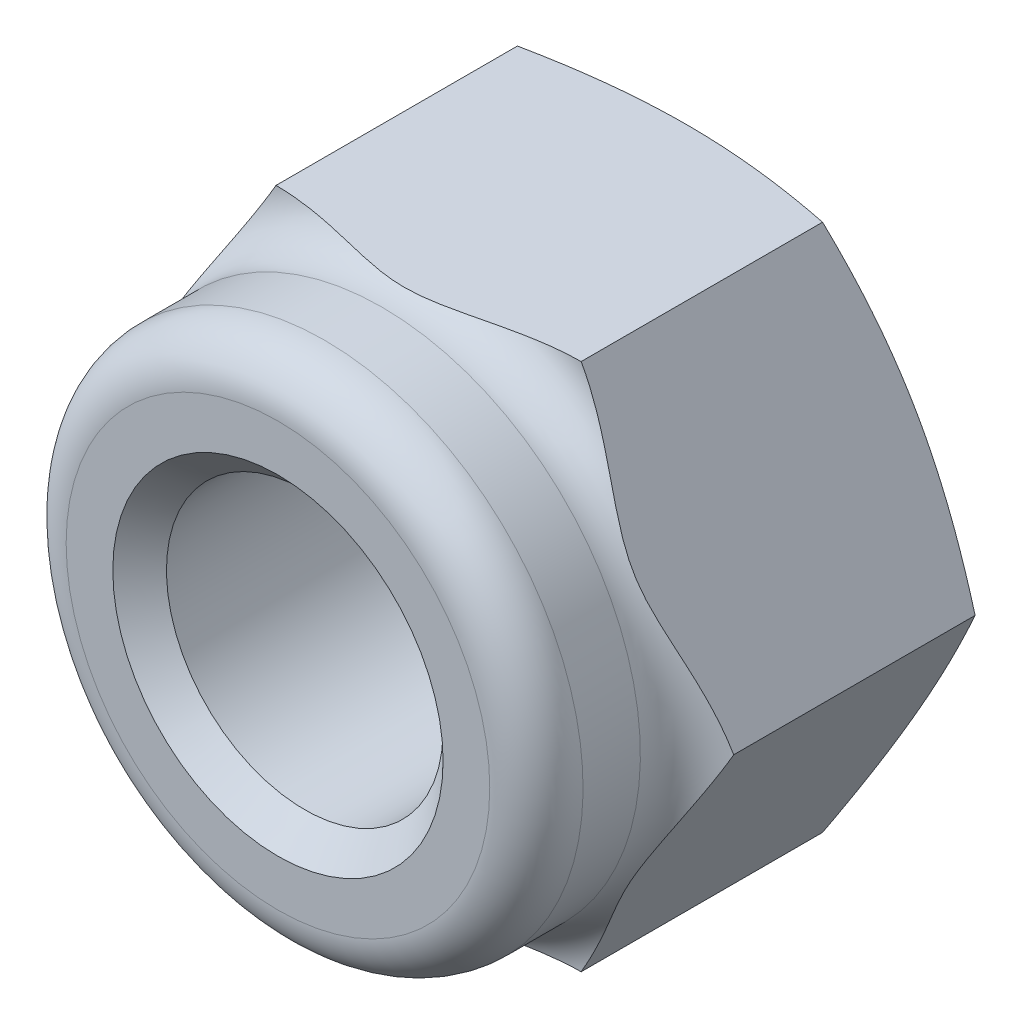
ISO-10303-21;
HEADER;
FILE_DESCRIPTION(('STEP AP214'),'2;1');
FILE_NAME('part.step','',(''),(''),'','','');
FILE_SCHEMA(('AUTOMOTIVE_DESIGN { 1 0 10303 214 1 1 1 1 }'));
ENDSEC;
DATA;
#1=APPLICATION_CONTEXT('core data for automotive mechanical design processes');
#2=APPLICATION_PROTOCOL_DEFINITION('international standard','automotive_design',2000,#1);
#3=PRODUCT_CONTEXT('',#1,'mechanical');
#4=PRODUCT('Part','Part','',(#3));
#5=PRODUCT_RELATED_PRODUCT_CATEGORY('part','',(#4));
#6=PRODUCT_DEFINITION_FORMATION('','',#4);
#7=PRODUCT_DEFINITION_CONTEXT('part definition',#1,'design');
#8=PRODUCT_DEFINITION('design','',#6,#7);
#9=PRODUCT_DEFINITION_SHAPE('','',#8);
#10=(LENGTH_UNIT() NAMED_UNIT(*) SI_UNIT(.MILLI.,.METRE.));
#11=(NAMED_UNIT(*) PLANE_ANGLE_UNIT() SI_UNIT($,.RADIAN.));
#12=(NAMED_UNIT(*) SI_UNIT($,.STERADIAN.) SOLID_ANGLE_UNIT());
#13=UNCERTAINTY_MEASURE_WITH_UNIT(LENGTH_MEASURE(1.E-05),#10,'distance_accuracy_value','');
#14=(GEOMETRIC_REPRESENTATION_CONTEXT(3) GLOBAL_UNCERTAINTY_ASSIGNED_CONTEXT((#13)) GLOBAL_UNIT_ASSIGNED_CONTEXT((#10,
#11,#12)) REPRESENTATION_CONTEXT('',''));
#15=CARTESIAN_POINT('',(0.,0.,0.));
#16=DIRECTION('',(0.,0.,1.));
#17=DIRECTION('',(1.,0.,0.));
#18=AXIS2_PLACEMENT_3D('',#15,#16,#17);
#19=CARTESIAN_POINT('',(0.,0.,0.));
#20=DIRECTION('',(0.,0.,1.));
#21=DIRECTION('',(0.,-0.999999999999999,0.));
#22=AXIS2_PLACEMENT_3D('',#19,#20,#21);
#23=CONICAL_SURFACE('',#22,7.42853651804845,1.18682389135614);
#24=CARTESIAN_POINT('',(0.,0.,0.));
#25=DIRECTION('',(0.,0.,1.));
#26=DIRECTION('',(0.999999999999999,0.,0.));
#27=AXIS2_PLACEMENT_3D('',#24,#25,#26);
#28=CIRCLE('',#27,7.42853651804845);
#29=CARTESIAN_POINT('',(7.42853651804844,0.,0.));
#30=VERTEX_POINT('',#29);
#31=EDGE_CURVE('E201',#30,#30,#28,.T.);
#32=ORIENTED_EDGE('',*,*,#31,.T.);
#33=EDGE_LOOP('',(#32));
#34=FACE_BOUND('',#33,.T.);
#35=CARTESIAN_POINT('',(4.61879988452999,7.99999646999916,0.730909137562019));
#36=CARTESIAN_POINT('',(4.78016828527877,7.72049820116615,0.665708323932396));
#37=CARTESIAN_POINT('',(4.94206929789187,7.44007742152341,0.605419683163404));
#38=CARTESIAN_POINT('',(5.26694187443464,6.87738161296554,0.496519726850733));
#39=CARTESIAN_POINT('',(5.4299140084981,6.5951055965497,0.447915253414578));
#40=CARTESIAN_POINT('',(5.75669685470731,6.02910110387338,0.364329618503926));
#41=CARTESIAN_POINT('',(5.9205073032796,5.74537308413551,0.329344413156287));
#42=CARTESIAN_POINT('',(6.24873668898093,5.1768631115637,0.274618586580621));
#43=CARTESIAN_POINT('',(6.41315548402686,4.8920814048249,0.254874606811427));
#44=CARTESIAN_POINT('',(6.73949003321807,4.32685338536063,0.231859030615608));
#45=CARTESIAN_POINT('',(6.90140088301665,4.04641556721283,0.228313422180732));
#46=CARTESIAN_POINT('',(7.22512690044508,3.48570565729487,0.237140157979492));
#47=CARTESIAN_POINT('',(7.38694205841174,3.20543358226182,0.249513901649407));
#48=CARTESIAN_POINT('',(7.70998795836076,2.64590167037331,0.289514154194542));
#49=CARTESIAN_POINT('',(7.87121900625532,2.36664130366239,0.317130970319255));
#50=CARTESIAN_POINT('',(8.19291130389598,1.80945389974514,0.386278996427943));
#51=CARTESIAN_POINT('',(8.3533726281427,1.53152673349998,0.427808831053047));
#52=CARTESIAN_POINT('',(8.57389118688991,1.149577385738,0.493455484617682));
#53=CARTESIAN_POINT('',(8.6343502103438,1.04485928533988,0.512346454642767));
#54=CARTESIAN_POINT('',(8.75512556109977,0.835670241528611,0.551773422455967));
#55=CARTESIAN_POINT('',(8.81544190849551,0.731199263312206,0.572309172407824));
#56=CARTESIAN_POINT('',(8.93614338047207,0.52213818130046,0.615003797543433));
#57=CARTESIAN_POINT('',(8.99652803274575,0.417548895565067,0.637167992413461));
#58=CARTESIAN_POINT('',(9.11716503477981,0.208599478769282,0.682963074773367));
#59=CARTESIAN_POINT('',(9.17741736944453,0.104239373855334,0.706594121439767));
#60=CARTESIAN_POINT('',(9.23760011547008,-1.99999974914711E-07,0.730909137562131));
#61=B_SPLINE_CURVE_WITH_KNOTS('',3,(#35,#36,#37,#38,#39,#40,#41,#42,#43,#44,#45,#46,#47,#48,#49,
#50,#51,#52,#53,#54,#55,#56,#57,#58,#59,#60),.UNSPECIFIED.,.F.,.F.,(4,2,2,2,2,2,2,2,2,2,2,2,4),
(0.,0.98784021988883,1.97625750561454,2.96438108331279,3.95228685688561,4.9234177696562,
5.89463405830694,6.86523348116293,7.83573698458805,8.20288448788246,8.56997677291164,
8.93832669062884,9.30671665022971),.UNSPECIFIED.);
#62=CARTESIAN_POINT('',(4.61880000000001,7.99999626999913,0.730909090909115));
#63=VERTEX_POINT('',#62);
#64=CARTESIAN_POINT('',(9.23760000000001,0.,0.730909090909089));
#65=VERTEX_POINT('',#64);
#66=EDGE_CURVE('E43',#63,#65,#61,.T.);
#67=ORIENTED_EDGE('',*,*,#66,.T.);
#68=CARTESIAN_POINT('',(9.23760011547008,2.00000023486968E-07,0.730909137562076));
#69=CARTESIAN_POINT('',(9.07623171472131,-0.279498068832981,0.665708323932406));
#70=CARTESIAN_POINT('',(8.91433070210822,-0.559918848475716,0.605419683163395));
#71=CARTESIAN_POINT('',(8.58945812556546,-1.12261465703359,0.496519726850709));
#72=CARTESIAN_POINT('',(8.42648599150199,-1.40489067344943,0.447915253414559));
#73=CARTESIAN_POINT('',(8.09970314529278,-1.97089516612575,0.364329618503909));
#74=CARTESIAN_POINT('',(7.93589269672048,-2.25462318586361,0.329344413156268));
#75=CARTESIAN_POINT('',(7.60766331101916,-2.82313315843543,0.2746185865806));
#76=CARTESIAN_POINT('',(7.44324451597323,-3.10791486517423,0.254874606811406));
#77=CARTESIAN_POINT('',(7.11690996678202,-3.67314288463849,0.231859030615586));
#78=CARTESIAN_POINT('',(6.95499911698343,-3.9535807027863,0.228313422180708));
#79=CARTESIAN_POINT('',(6.63127309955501,-4.51429061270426,0.237140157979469));
#80=CARTESIAN_POINT('',(6.46945794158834,-4.79456268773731,0.249513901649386));
#81=CARTESIAN_POINT('',(6.14641204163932,-5.35409459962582,0.289514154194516));
#82=CARTESIAN_POINT('',(5.98518099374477,-5.63335496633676,0.317130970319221));
#83=CARTESIAN_POINT('',(5.66348869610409,-6.19054237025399,0.386278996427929));
#84=CARTESIAN_POINT('',(5.50302737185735,-6.46846953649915,0.427808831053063));
#85=CARTESIAN_POINT('',(5.28250881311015,-6.85041888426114,0.493455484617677));
#86=CARTESIAN_POINT('',(5.22204978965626,-6.95513698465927,0.51234645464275));
#87=CARTESIAN_POINT('',(5.1012744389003,-7.16432602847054,0.55177342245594));
#88=CARTESIAN_POINT('',(5.04095809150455,-7.26879700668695,0.572309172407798));
#89=CARTESIAN_POINT('',(4.920256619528,-7.47785808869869,0.615003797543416));
#90=CARTESIAN_POINT('',(4.85987196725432,-7.58244737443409,0.637167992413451));
#91=CARTESIAN_POINT('',(4.73923496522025,-7.79139679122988,0.682963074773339));
#92=CARTESIAN_POINT('',(4.67898263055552,-7.89575689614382,0.706594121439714));
#93=CARTESIAN_POINT('',(4.61879988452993,-7.99999646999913,0.730909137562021));
#94=B_SPLINE_CURVE_WITH_KNOTS('',3,(#68,#69,#70,#71,#72,#73,#74,#75,#76,#77,#78,#79,#80,#81,#82,
#83,#84,#85,#86,#87,#88,#89,#90,#91,#92,#93),.UNSPECIFIED.,.F.,.F.,(4,2,2,2,2,2,2,2,2,2,2,2,4),
(0.,0.987840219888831,1.97625750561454,2.96438108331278,3.9522868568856,4.9234177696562,
5.89463405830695,6.86523348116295,7.83573698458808,8.20288448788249,8.56997677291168,
8.93832669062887,9.30671665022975),.UNSPECIFIED.);
#95=CARTESIAN_POINT('',(4.61879999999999,-7.99999626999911,0.730909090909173));
#96=VERTEX_POINT('',#95);
#97=EDGE_CURVE('E36',#65,#96,#94,.T.);
#98=ORIENTED_EDGE('',*,*,#97,.T.);
#99=CARTESIAN_POINT('',(-12.2114986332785,-7.99999626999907,2.89691468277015));
#100=CARTESIAN_POINT('',(-11.850631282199,-7.9999962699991,2.77499057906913));
#101=CARTESIAN_POINT('',(-11.4892839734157,-7.99999626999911,2.65446084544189));
#102=CARTESIAN_POINT('',(-10.7653811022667,-7.99999626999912,2.41696916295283));
#103=CARTESIAN_POINT('',(-10.4028254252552,-7.99999626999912,2.30000756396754));
#104=CARTESIAN_POINT('',(-9.6754510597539,-7.99999626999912,2.07017826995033));
#105=CARTESIAN_POINT('',(-9.3106290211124,-7.99999626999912,1.95732113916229));
#106=CARTESIAN_POINT('',(-8.57933767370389,-7.99999626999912,1.73708762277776));
#107=CARTESIAN_POINT('',(-8.21286840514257,-7.99999626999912,1.62971110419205));
#108=CARTESIAN_POINT('',(-7.4827080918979,-7.99999626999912,1.42315638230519));
#109=CARTESIAN_POINT('',(-7.11904198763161,-7.99999626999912,1.32389045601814));
#110=CARTESIAN_POINT('',(-6.3894979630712,-7.99999626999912,1.13374082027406));
#111=CARTESIAN_POINT('',(-6.02361997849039,-7.99999626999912,1.04285735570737));
#112=CARTESIAN_POINT('',(-5.28959914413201,-7.99999626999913,0.871643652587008));
#113=CARTESIAN_POINT('',(-4.9214576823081,-7.99999626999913,0.791307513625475));
#114=CARTESIAN_POINT('',(-4.18255808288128,-7.99999626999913,0.643671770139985));
#115=CARTESIAN_POINT('',(-3.81180013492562,-7.99999626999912,0.57637123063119));
#116=CARTESIAN_POINT('',(-3.14382070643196,-7.99999626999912,0.469769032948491));
#117=CARTESIAN_POINT('',(-2.84706620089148,-7.99999626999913,0.427556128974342));
#118=CARTESIAN_POINT('',(-2.25214274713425,-7.99999626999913,0.354571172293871));
#119=CARTESIAN_POINT('',(-1.95397383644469,-7.99999626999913,0.323798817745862));
#120=CARTESIAN_POINT('',(-1.35678126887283,-7.99999626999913,0.274913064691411));
#121=CARTESIAN_POINT('',(-1.05775829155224,-7.99999626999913,0.256791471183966));
#122=CARTESIAN_POINT('',(-0.459195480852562,-7.99999626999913,0.233966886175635));
#123=CARTESIAN_POINT('',(-0.159655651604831,-7.99999626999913,0.229263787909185));
#124=CARTESIAN_POINT('',(0.440773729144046,-7.99999626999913,0.233503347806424));
#125=CARTESIAN_POINT('',(0.741662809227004,-7.99999626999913,0.242512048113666));
#126=CARTESIAN_POINT('',(1.34273869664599,-7.99999626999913,0.273882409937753));
#127=CARTESIAN_POINT('',(1.64292549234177,-7.99999626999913,0.296244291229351));
#128=CARTESIAN_POINT('',(2.24229354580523,-7.99999626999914,0.35338151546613));
#129=CARTESIAN_POINT('',(2.54147403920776,-7.99999626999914,0.388164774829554));
#130=CARTESIAN_POINT('',(3.13831538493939,-7.99999626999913,0.468832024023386));
#131=CARTESIAN_POINT('',(3.43597624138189,-7.99999626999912,0.514715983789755));
#132=CARTESIAN_POINT('',(4.07914989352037,-7.99999626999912,0.624591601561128));
#133=CARTESIAN_POINT('',(4.42436283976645,-7.99999626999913,0.690327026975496));
#134=CARTESIAN_POINT('',(5.11255407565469,-7.99999626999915,0.832685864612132));
#135=CARTESIAN_POINT('',(5.45553208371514,-7.99999626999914,0.909310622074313));
#136=CARTESIAN_POINT('',(6.13953783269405,-7.99999626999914,1.07147580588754));
#137=CARTESIAN_POINT('',(6.48056452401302,-7.99999626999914,1.15702062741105));
#138=CARTESIAN_POINT('',(7.16070701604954,-7.99999626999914,1.3353047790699));
#139=CARTESIAN_POINT('',(7.4998228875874,-7.99999626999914,1.42804384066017));
#140=CARTESIAN_POINT('',(8.1772890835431,-7.99999626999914,1.619601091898));
#141=CARTESIAN_POINT('',(8.51563505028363,-7.99999626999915,1.71843462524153));
#142=CARTESIAN_POINT('',(9.19089832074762,-7.99999626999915,1.92085902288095));
#143=CARTESIAN_POINT('',(9.52781561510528,-7.99999626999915,2.02444991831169));
#144=CARTESIAN_POINT('',(10.200335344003,-7.99999626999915,2.23548482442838));
#145=CARTESIAN_POINT('',(10.5359381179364,-7.99999626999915,2.34292775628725));
#146=CARTESIAN_POINT('',(11.2061050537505,-7.99999626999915,2.56100962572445));
#147=CARTESIAN_POINT('',(11.540669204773,-7.99999626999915,2.67164859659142));
#148=CARTESIAN_POINT('',(12.5385749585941,-7.99999626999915,3.00601217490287));
#149=CARTESIAN_POINT('',(13.200618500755,-7.99999626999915,3.23360955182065));
#150=CARTESIAN_POINT('',(14.522199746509,-7.99999626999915,3.69608201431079));
#151=CARTESIAN_POINT('',(15.1817372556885,-7.99999626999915,3.93095765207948));
#152=CARTESIAN_POINT('',(16.4945438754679,-7.99999626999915,4.40441186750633));
#153=CARTESIAN_POINT('',(17.1478255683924,-7.99999626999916,4.6429556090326));
#154=CARTESIAN_POINT('',(18.1266306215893,-7.99999626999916,5.00366800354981));
#155=CARTESIAN_POINT('',(18.4526922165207,-7.99999626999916,5.12438056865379));
#156=CARTESIAN_POINT('',(19.1044972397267,-7.99999626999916,5.36665818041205));
#157=CARTESIAN_POINT('',(19.4302406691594,-7.99999626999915,5.48822322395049));
#158=CARTESIAN_POINT('',(19.7558464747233,-7.99999626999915,5.61015598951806));
#159=B_SPLINE_CURVE_WITH_KNOTS('',3,(#99,#100,#101,#102,#103,#104,#105,#106,#107,#108,#109,#110,
#111,#112,#113,#114,#115,#116,#117,#118,#119,#120,#121,#122,#123,#124,#125,#126,#127,#128,#129,
#130,#131,#132,#133,#134,#135,#136,#137,#138,#139,#140,#141,#142,#143,#144,#145,#146,#147,#148,
#149,#150,#151,#152,#153,#154,#155,#156,#157,#158),.UNSPECIFIED.,.F.,.F.,(4,2,2,2,2,2,2,2,2,2,2,
2,2,2,2,2,2,2,2,2,2,2,2,2,2,2,2,2,2,4),(0.,1.14273303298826,2.28557775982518,3.43118130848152,
4.57675704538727,5.7075900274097,6.83845603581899,7.96868669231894,9.09883625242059,
9.99787033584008,10.8968806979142,11.7953081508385,12.6937284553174,13.596489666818,
14.4992657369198,15.4026181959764,16.3059682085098,17.3599963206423,18.4141547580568,
19.4688350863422,20.5234760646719,21.5808901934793,22.6383112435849,23.6954384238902,
24.7525766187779,26.852725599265,28.9530343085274,31.0394299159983,32.0824962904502,
33.1255588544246),.UNSPECIFIED.);
#160=CARTESIAN_POINT('',(-4.61879999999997,-7.99999626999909,0.7309090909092));
#161=VERTEX_POINT('',#160);
#162=EDGE_CURVE('E81',#96,#161,#159,.F.);
#163=ORIENTED_EDGE('',*,*,#162,.T.);
#164=CARTESIAN_POINT('',(-4.61879988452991,-7.99999646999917,0.730909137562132));
#165=CARTESIAN_POINT('',(-4.78016828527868,-7.72049820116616,0.665708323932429));
#166=CARTESIAN_POINT('',(-4.94206929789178,-7.44007742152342,0.605419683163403));
#167=CARTESIAN_POINT('',(-5.26694187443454,-6.87738161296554,0.496519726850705));
#168=CARTESIAN_POINT('',(-5.42991400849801,-6.59510559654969,0.447915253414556));
#169=CARTESIAN_POINT('',(-5.75669685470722,-6.02910110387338,0.36432961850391));
#170=CARTESIAN_POINT('',(-5.92050730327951,-5.74537308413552,0.32934441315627));
#171=CARTESIAN_POINT('',(-6.24873668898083,-5.17686311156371,0.274618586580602));
#172=CARTESIAN_POINT('',(-6.41315548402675,-4.89208140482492,0.254874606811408));
#173=CARTESIAN_POINT('',(-6.73949003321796,-4.32685338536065,0.231859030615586));
#174=CARTESIAN_POINT('',(-6.90140088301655,-4.04641556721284,0.228313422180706));
#175=CARTESIAN_POINT('',(-7.22512690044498,-3.48570565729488,0.237140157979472));
#176=CARTESIAN_POINT('',(-7.38694205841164,-3.20543358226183,0.249513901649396));
#177=CARTESIAN_POINT('',(-7.70998795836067,-2.64590167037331,0.289514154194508));
#178=CARTESIAN_POINT('',(-7.87121900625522,-2.36664130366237,0.317130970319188));
#179=CARTESIAN_POINT('',(-8.19291130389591,-1.80945389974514,0.386278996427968));
#180=CARTESIAN_POINT('',(-8.35337262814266,-1.5315267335,0.427808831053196));
#181=CARTESIAN_POINT('',(-8.57389118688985,-1.14957738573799,0.49345548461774));
#182=CARTESIAN_POINT('',(-8.63435021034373,-1.04485928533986,0.512346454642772));
#183=CARTESIAN_POINT('',(-8.7551255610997,-0.835670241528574,0.551773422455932));
#184=CARTESIAN_POINT('',(-8.81544190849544,-0.731199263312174,0.572309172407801));
#185=CARTESIAN_POINT('',(-8.93614338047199,-0.522138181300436,0.615003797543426));
#186=CARTESIAN_POINT('',(-8.99652803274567,-0.417548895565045,0.637167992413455));
#187=CARTESIAN_POINT('',(-9.11716503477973,-0.208599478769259,0.682963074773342));
#188=CARTESIAN_POINT('',(-9.17741736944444,-0.104239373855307,0.706594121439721));
#189=CARTESIAN_POINT('',(-9.23760011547,2.0000000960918E-07,0.730909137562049));
#190=B_SPLINE_CURVE_WITH_KNOTS('',3,(#164,#165,#166,#167,#168,#169,#170,#171,#172,#173,#174,
#175,#176,#177,#178,#179,#180,#181,#182,#183,#184,#185,#186,#187,#188,#189),.UNSPECIFIED.,.F.,
.F.,(4,2,2,2,2,2,2,2,2,2,2,2,4),(0.,0.987840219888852,1.97625750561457,2.9643810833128,
3.95228685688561,4.92341776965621,5.89463405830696,6.86523348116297,7.83573698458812,
8.20288448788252,8.5699767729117,8.93832669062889,9.30671665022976),.UNSPECIFIED.);
#191=CARTESIAN_POINT('',(-9.23760000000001,0.,0.730909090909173));
#192=VERTEX_POINT('',#191);
#193=EDGE_CURVE('E89',#161,#192,#190,.T.);
#194=ORIENTED_EDGE('',*,*,#193,.T.);
#195=CARTESIAN_POINT('',(-9.23760011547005,-1.99999995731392E-07,0.730909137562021));
#196=CARTESIAN_POINT('',(-9.07623171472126,0.279498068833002,0.66570832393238));
#197=CARTESIAN_POINT('',(-8.91433070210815,0.559918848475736,0.605419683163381));
#198=CARTESIAN_POINT('',(-8.58945812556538,1.12261465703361,0.496519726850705));
#199=CARTESIAN_POINT('',(-8.42648599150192,1.40489067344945,0.447915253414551));
#200=CARTESIAN_POINT('',(-8.09970314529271,1.97089516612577,0.3643296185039));
#201=CARTESIAN_POINT('',(-7.93589269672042,2.25462318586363,0.329344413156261));
#202=CARTESIAN_POINT('',(-7.60766331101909,2.82313315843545,0.274618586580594));
#203=CARTESIAN_POINT('',(-7.44324451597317,3.10791486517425,0.2548746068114));
#204=CARTESIAN_POINT('',(-7.11690996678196,3.67314288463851,0.231859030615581));
#205=CARTESIAN_POINT('',(-6.95499911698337,3.95358070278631,0.228313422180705));
#206=CARTESIAN_POINT('',(-6.63127309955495,4.51429061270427,0.237140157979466));
#207=CARTESIAN_POINT('',(-6.46945794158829,4.79456268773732,0.249513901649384));
#208=CARTESIAN_POINT('',(-6.14641204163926,5.35409459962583,0.289514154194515));
#209=CARTESIAN_POINT('',(-5.9851809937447,5.63335496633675,0.317130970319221));
#210=CARTESIAN_POINT('',(-5.66348869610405,6.190542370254,0.386278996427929));
#211=CARTESIAN_POINT('',(-5.50302737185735,6.46846953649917,0.427808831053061));
#212=CARTESIAN_POINT('',(-5.28250881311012,6.85041888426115,0.493455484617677));
#213=CARTESIAN_POINT('',(-5.22204978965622,6.95513698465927,0.512346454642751));
#214=CARTESIAN_POINT('',(-5.10127443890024,7.16432602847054,0.551773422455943));
#215=CARTESIAN_POINT('',(-5.0409580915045,7.26879700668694,0.572309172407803));
#216=CARTESIAN_POINT('',(-4.92025661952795,7.47785808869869,0.615003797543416));
#217=CARTESIAN_POINT('',(-4.85987196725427,7.58244737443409,0.637167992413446));
#218=CARTESIAN_POINT('',(-4.7392349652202,7.79139679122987,0.682963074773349));
#219=CARTESIAN_POINT('',(-4.67898263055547,7.89575689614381,0.706594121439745));
#220=CARTESIAN_POINT('',(-4.61879988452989,7.99999646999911,0.730909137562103));
#221=B_SPLINE_CURVE_WITH_KNOTS('',3,(#195,#196,#197,#198,#199,#200,#201,#202,#203,#204,#205,
#206,#207,#208,#209,#210,#211,#212,#213,#214,#215,#216,#217,#218,#219,#220),.UNSPECIFIED.,.F.,
.F.,(4,2,2,2,2,2,2,2,2,2,2,2,4),(0.,0.987840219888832,1.97625750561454,2.96438108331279,
3.9522868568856,4.9234177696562,5.89463405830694,6.86523348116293,7.83573698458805,
8.20288448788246,8.56997677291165,8.93832669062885,9.30671665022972),.UNSPECIFIED.);
#222=CARTESIAN_POINT('',(-4.61879999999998,7.99999626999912,0.730909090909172));
#223=VERTEX_POINT('',#222);
#224=EDGE_CURVE('E94',#192,#223,#221,.T.);
#225=ORIENTED_EDGE('',*,*,#224,.T.);
#226=CARTESIAN_POINT('',(-12.2114986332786,7.99999626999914,2.89691468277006));
#227=CARTESIAN_POINT('',(-11.850631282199,7.99999626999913,2.7749905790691));
#228=CARTESIAN_POINT('',(-11.4892839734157,7.99999626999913,2.65446084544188));
#229=CARTESIAN_POINT('',(-10.7653811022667,7.99999626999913,2.41696916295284));
#230=CARTESIAN_POINT('',(-10.4028254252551,7.99999626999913,2.30000756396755));
#231=CARTESIAN_POINT('',(-9.67545105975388,7.99999626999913,2.07017826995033));
#232=CARTESIAN_POINT('',(-9.31062902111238,7.99999626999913,1.95732113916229));
#233=CARTESIAN_POINT('',(-8.57933767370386,7.99999626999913,1.73708762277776));
#234=CARTESIAN_POINT('',(-8.21286840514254,7.99999626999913,1.62971110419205));
#235=CARTESIAN_POINT('',(-7.48270809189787,7.99999626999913,1.42315638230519));
#236=CARTESIAN_POINT('',(-7.11904198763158,7.99999626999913,1.32389045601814));
#237=CARTESIAN_POINT('',(-6.38949796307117,7.99999626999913,1.13374082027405));
#238=CARTESIAN_POINT('',(-6.02361997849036,7.99999626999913,1.04285735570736));
#239=CARTESIAN_POINT('',(-5.28959914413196,7.99999626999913,0.871643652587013));
#240=CARTESIAN_POINT('',(-4.92145768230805,7.99999626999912,0.791307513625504));
#241=CARTESIAN_POINT('',(-4.18255808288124,7.99999626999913,0.643671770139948));
#242=CARTESIAN_POINT('',(-3.8118001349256,7.99999626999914,0.576371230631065));
#243=CARTESIAN_POINT('',(-3.14382070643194,7.99999626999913,0.469769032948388));
#244=CARTESIAN_POINT('',(-2.84706620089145,7.99999626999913,0.427556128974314));
#245=CARTESIAN_POINT('',(-2.25214274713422,7.99999626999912,0.354571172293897));
#246=CARTESIAN_POINT('',(-1.95397383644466,7.99999626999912,0.323798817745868));
#247=CARTESIAN_POINT('',(-1.3567812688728,7.99999626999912,0.274913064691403));
#248=CARTESIAN_POINT('',(-1.05775829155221,7.99999626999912,0.256791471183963));
#249=CARTESIAN_POINT('',(-0.459195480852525,7.99999626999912,0.233966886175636));
#250=CARTESIAN_POINT('',(-0.159655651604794,7.99999626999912,0.229263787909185));
#251=CARTESIAN_POINT('',(0.440773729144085,7.99999626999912,0.233503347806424));
#252=CARTESIAN_POINT('',(0.741662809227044,7.99999626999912,0.242512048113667));
#253=CARTESIAN_POINT('',(1.34273869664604,7.99999626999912,0.273882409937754));
#254=CARTESIAN_POINT('',(1.64292549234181,7.99999626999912,0.296244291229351));
#255=CARTESIAN_POINT('',(2.24229354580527,7.99999626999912,0.353381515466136));
#256=CARTESIAN_POINT('',(2.5414740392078,7.99999626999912,0.388164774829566));
#257=CARTESIAN_POINT('',(3.13831538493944,7.99999626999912,0.468832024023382));
#258=CARTESIAN_POINT('',(3.43597624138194,7.99999626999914,0.514715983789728));
#259=CARTESIAN_POINT('',(4.07914989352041,7.99999626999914,0.624591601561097));
#260=CARTESIAN_POINT('',(4.42436283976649,7.99999626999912,0.690327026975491));
#261=CARTESIAN_POINT('',(5.11255407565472,7.99999626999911,0.832685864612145));
#262=CARTESIAN_POINT('',(5.45553208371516,7.99999626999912,0.909310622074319));
#263=CARTESIAN_POINT('',(6.13953783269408,7.99999626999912,1.07147580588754));
#264=CARTESIAN_POINT('',(6.48056452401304,7.99999626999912,1.15702062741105));
#265=CARTESIAN_POINT('',(7.16070701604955,7.99999626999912,1.3353047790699));
#266=CARTESIAN_POINT('',(7.49982288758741,7.99999626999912,1.42804384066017));
#267=CARTESIAN_POINT('',(8.17728908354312,7.99999626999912,1.619601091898));
#268=CARTESIAN_POINT('',(8.51563505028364,7.99999626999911,1.71843462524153));
#269=CARTESIAN_POINT('',(9.19089832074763,7.99999626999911,1.92085902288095));
#270=CARTESIAN_POINT('',(9.52781561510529,7.99999626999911,2.02444991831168));
#271=CARTESIAN_POINT('',(10.200335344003,7.99999626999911,2.23548482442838));
#272=CARTESIAN_POINT('',(10.5359381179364,7.99999626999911,2.34292775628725));
#273=CARTESIAN_POINT('',(11.2061050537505,7.99999626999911,2.56100962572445));
#274=CARTESIAN_POINT('',(11.5406692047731,7.99999626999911,2.67164859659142));
#275=CARTESIAN_POINT('',(12.5385749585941,7.99999626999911,3.00601217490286));
#276=CARTESIAN_POINT('',(13.200618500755,7.99999626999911,3.23360955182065));
#277=CARTESIAN_POINT('',(14.522199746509,7.99999626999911,3.69608201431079));
#278=CARTESIAN_POINT('',(15.1817372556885,7.99999626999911,3.93095765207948));
#279=CARTESIAN_POINT('',(16.4945438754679,7.99999626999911,4.40441186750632));
#280=CARTESIAN_POINT('',(17.1478255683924,7.99999626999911,4.64295560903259));
#281=CARTESIAN_POINT('',(18.1266306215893,7.99999626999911,5.0036680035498));
#282=CARTESIAN_POINT('',(18.4526922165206,7.99999626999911,5.12438056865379));
#283=CARTESIAN_POINT('',(19.1044972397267,7.99999626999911,5.36665818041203));
#284=CARTESIAN_POINT('',(19.4302406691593,7.99999626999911,5.48822322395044));
#285=CARTESIAN_POINT('',(19.7558464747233,7.99999626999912,5.61015598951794));
#286=B_SPLINE_CURVE_WITH_KNOTS('',3,(#226,#227,#228,#229,#230,#231,#232,#233,#234,#235,#236,
#237,#238,#239,#240,#241,#242,#243,#244,#245,#246,#247,#248,#249,#250,#251,#252,#253,#254,#255,
#256,#257,#258,#259,#260,#261,#262,#263,#264,#265,#266,#267,#268,#269,#270,#271,#272,#273,#274,
#275,#276,#277,#278,#279,#280,#281,#282,#283,#284,#285),.UNSPECIFIED.,.F.,.F.,(4,2,2,2,2,2,2,2,
2,2,2,2,2,2,2,2,2,2,2,2,2,2,2,2,2,2,2,2,2,4),(0.,1.14273303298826,2.28557775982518,
3.43118130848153,4.5767570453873,5.70759002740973,6.83845603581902,7.96868669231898,
9.09883625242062,9.99787033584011,10.8968806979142,11.7953081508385,12.6937284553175,
13.5964896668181,14.4992657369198,15.4026181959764,16.3059682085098,17.3599963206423,
18.4141547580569,19.4688350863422,20.5234760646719,21.5808901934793,22.6383112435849,
23.6954384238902,24.7525766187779,26.852725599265,28.9530343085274,31.0394299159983,
32.0824962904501,33.1255588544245),.UNSPECIFIED.);
#287=EDGE_CURVE('E179',#223,#63,#286,.T.);
#288=ORIENTED_EDGE('',*,*,#287,.T.);
#289=EDGE_LOOP('',(#67,#98,#163,#194,#225,#288));
#290=FACE_BOUND('',#289,.T.);
#291=ADVANCED_FACE('F16',(#34,#290),#23,.T.);
#292=CARTESIAN_POINT('',(9.23760000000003,0.,0.));
#293=DIRECTION('',(0.,0.,1.));
#294=DIRECTION('',(0.999999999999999,0.,0.));
#295=AXIS2_PLACEMENT_3D('',#292,#293,#294);
#296=PLANE('',#295);
#297=CARTESIAN_POINT('',(0.,0.,0.));
#298=DIRECTION('',(0.,0.,1.));
#299=DIRECTION('',(0.999999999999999,0.,0.));
#300=AXIS2_PLACEMENT_3D('',#297,#298,#299);
#301=CIRCLE('',#300,5.);
#302=CARTESIAN_POINT('',(5.,0.,0.));
#303=VERTEX_POINT('',#302);
#304=EDGE_CURVE('E204',#303,#303,#301,.F.);
#305=ORIENTED_EDGE('',*,*,#304,.F.);
#306=EDGE_LOOP('',(#305));
#307=FACE_BOUND('',#306,.T.);
#308=ORIENTED_EDGE('',*,*,#31,.F.);
#309=EDGE_LOOP('',(#308));
#310=FACE_BOUND('',#309,.T.);
#311=ADVANCED_FACE('F223',(#307,#310),#296,.F.);
#312=CARTESIAN_POINT('',(0.,0.,12.6));
#313=DIRECTION('',(0.,0.,1.));
#314=DIRECTION('',(0.,-0.999999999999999,0.));
#315=AXIS2_PLACEMENT_3D('',#312,#313,#314);
#316=CONICAL_SURFACE('',#315,5.,0.785398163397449);
#317=CARTESIAN_POINT('',(0.,0.,11.788125));
#318=DIRECTION('',(0.,0.,-1.));
#319=DIRECTION('',(0.,0.999999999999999,0.));
#320=AXIS2_PLACEMENT_3D('',#317,#318,#319);
#321=CIRCLE('',#320,4.188125);
#322=CARTESIAN_POINT('',(0.,4.188125,11.788125));
#323=VERTEX_POINT('',#322);
#324=EDGE_CURVE('E243',#323,#323,#321,.T.);
#325=ORIENTED_EDGE('',*,*,#324,.T.);
#326=EDGE_LOOP('',(#325));
#327=FACE_BOUND('',#326,.T.);
#328=CARTESIAN_POINT('',(0.,0.,12.6));
#329=DIRECTION('',(0.,0.,-1.));
#330=DIRECTION('',(0.,0.999999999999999,0.));
#331=AXIS2_PLACEMENT_3D('',#328,#329,#330);
#332=CIRCLE('',#331,5.);
#333=CARTESIAN_POINT('',(0.,5.00000000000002,12.6));
#334=VERTEX_POINT('',#333);
#335=EDGE_CURVE('E246',#334,#334,#332,.T.);
#336=ORIENTED_EDGE('',*,*,#335,.F.);
#337=EDGE_LOOP('',(#336));
#338=FACE_BOUND('',#337,.T.);
#339=ADVANCED_FACE('F228',(#327,#338),#316,.F.);
#340=CARTESIAN_POINT('',(0.,0.,0.));
#341=DIRECTION('',(0.,0.,-1.));
#342=DIRECTION('',(0.,0.999999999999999,0.));
#343=AXIS2_PLACEMENT_3D('',#340,#341,#342);
#344=CYLINDRICAL_SURFACE('',#343,4.188125);
#345=CARTESIAN_POINT('',(0.,0.,0.811875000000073));
#346=DIRECTION('',(0.,0.,-1.));
#347=DIRECTION('',(0.,0.999999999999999,0.));
#348=AXIS2_PLACEMENT_3D('',#345,#346,#347);
#349=CIRCLE('',#348,4.188125);
#350=CARTESIAN_POINT('',(0.,4.188125,0.811875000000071));
#351=VERTEX_POINT('',#350);
#352=EDGE_CURVE('E241',#351,#351,#349,.T.);
#353=ORIENTED_EDGE('',*,*,#352,.T.);
#354=EDGE_LOOP('',(#353));
#355=FACE_BOUND('',#354,.T.);
#356=ORIENTED_EDGE('',*,*,#324,.F.);
#357=EDGE_LOOP('',(#356));
#358=FACE_BOUND('',#357,.T.);
#359=ADVANCED_FACE('F219',(#355,#358),#344,.F.);
#360=CARTESIAN_POINT('',(0.,0.,0.811875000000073));
#361=DIRECTION('',(0.,0.,-1.));
#362=DIRECTION('',(0.,0.999999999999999,0.));
#363=AXIS2_PLACEMENT_3D('',#360,#361,#362);
#364=CONICAL_SURFACE('',#363,4.188125,0.785398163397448);
#365=ORIENTED_EDGE('',*,*,#304,.T.);
#366=EDGE_LOOP('',(#365));
#367=FACE_BOUND('',#366,.T.);
#368=ORIENTED_EDGE('',*,*,#352,.F.);
#369=EDGE_LOOP('',(#368));
#370=FACE_BOUND('',#369,.T.);
#371=ADVANCED_FACE('F213',(#367,#370),#364,.F.);
#372=CARTESIAN_POINT('',(9.23760000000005,0.,12.6));
#373=DIRECTION('',(0.,0.,1.));
#374=DIRECTION('',(0.999999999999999,0.,0.));
#375=AXIS2_PLACEMENT_3D('',#372,#373,#374);
#376=PLANE('',#375);
#377=ORIENTED_EDGE('',*,*,#335,.T.);
#378=EDGE_LOOP('',(#377));
#379=FACE_BOUND('',#378,.T.);
#380=CARTESIAN_POINT('',(0.,0.,12.6));
#381=DIRECTION('',(0.,0.,-1.));
#382=DIRECTION('',(0.,0.999999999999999,0.));
#383=AXIS2_PLACEMENT_3D('',#380,#381,#382);
#384=CIRCLE('',#383,6.41253333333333);
#385=CARTESIAN_POINT('',(0.,6.41253333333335,12.6));
#386=VERTEX_POINT('',#385);
#387=EDGE_CURVE('E29',#386,#386,#384,.T.);
#388=ORIENTED_EDGE('',*,*,#387,.F.);
#389=EDGE_LOOP('',(#388));
#390=FACE_BOUND('',#389,.T.);
#391=ADVANCED_FACE('F116',(#379,#390),#376,.T.);
#392=CARTESIAN_POINT('',(0.,0.,9.4525333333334));
#393=DIRECTION('',(0.,0.,-1.));
#394=DIRECTION('',(0.,0.999999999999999,0.));
#395=AXIS2_PLACEMENT_3D('',#392,#393,#394);
#396=TOROIDAL_SURFACE('',#395,9.2376,1.41253333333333);
#397=CARTESIAN_POINT('',(0.,0.,9.4525333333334));
#398=DIRECTION('',(0.,0.,-1.));
#399=DIRECTION('',(0.,0.999999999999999,0.));
#400=AXIS2_PLACEMENT_3D('',#397,#398,#399);
#401=CIRCLE('',#400,7.82506666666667);
#402=CARTESIAN_POINT('',(0.,7.82506666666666,9.4525333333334));
#403=VERTEX_POINT('',#402);
#404=EDGE_CURVE('E96',#403,#403,#401,.T.);
#405=ORIENTED_EDGE('',*,*,#404,.T.);
#406=EDGE_LOOP('',(#405));
#407=FACE_BOUND('',#406,.T.);
#408=CARTESIAN_POINT('',(9.23760011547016,2.00000002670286E-07,8.03999999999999));
#409=CARTESIAN_POINT('',(9.18217369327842,-0.096001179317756,8.04002187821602));
#410=CARTESIAN_POINT('',(9.12677243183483,-0.19195897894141,8.04326050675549));
#411=CARTESIAN_POINT('',(9.01616180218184,-0.383542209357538,8.05528128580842));
#412=CARTESIAN_POINT('',(8.96095231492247,-0.479167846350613,8.06405894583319));
#413=CARTESIAN_POINT('',(8.85102324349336,-0.66957058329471,8.08622101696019));
#414=CARTESIAN_POINT('',(8.79630257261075,-0.764349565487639,8.0995846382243));
#415=CARTESIAN_POINT('',(8.68712304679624,-0.953454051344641,8.13017135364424));
#416=CARTESIAN_POINT('',(8.63266425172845,-1.04777945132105,8.1473952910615));
#417=CARTESIAN_POINT('',(8.46911292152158,-1.33105866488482,8.20399460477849));
#418=CARTESIAN_POINT('',(8.36043884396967,-1.5192876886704,8.24816249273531));
#419=CARTESIAN_POINT('',(8.19794037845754,-1.80074328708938,8.31974079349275));
#420=CARTESIAN_POINT('',(8.14380665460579,-1.89450564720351,8.3445149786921));
#421=CARTESIAN_POINT('',(8.03565416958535,-2.08183124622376,8.39505299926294));
#422=CARTESIAN_POINT('',(7.9816354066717,-2.17539448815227,8.4208168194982));
#423=CARTESIAN_POINT('',(7.87366345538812,-2.36240739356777,8.47242269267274));
#424=CARTESIAN_POINT('',(7.81971025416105,-2.45585707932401,8.49826464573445));
#425=CARTESIAN_POINT('',(7.71169136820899,-2.64295127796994,8.5489835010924));
#426=CARTESIAN_POINT('',(7.65762568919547,-2.73659578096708,8.57386045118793));
#427=CARTESIAN_POINT('',(7.5493484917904,-2.92413738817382,8.62126840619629));
#428=CARTESIAN_POINT('',(7.49513749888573,-3.01803358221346,8.64380411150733));
#429=CARTESIAN_POINT('',(7.38633012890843,-3.2064934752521,8.68493584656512));
#430=CARTESIAN_POINT('',(7.33173373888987,-3.30105719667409,8.70353174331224));
#431=CARTESIAN_POINT('',(7.22209005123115,-3.4909656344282,8.73487795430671));
#432=CARTESIAN_POINT('',(7.16704263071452,-3.58631056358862,8.74762661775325));
#433=CARTESIAN_POINT('',(7.05664450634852,-3.77752572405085,8.76549966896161));
#434=CARTESIAN_POINT('',(7.00129392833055,-3.87339573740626,8.77062701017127));
#435=CARTESIAN_POINT('',(6.89053397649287,-4.06523760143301,8.77240942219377));
#436=CARTESIAN_POINT('',(6.83512458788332,-4.16120947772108,8.7690610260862));
#437=CARTESIAN_POINT('',(6.72456380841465,-4.35270636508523,8.75445292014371));
#438=CARTESIAN_POINT('',(6.66941250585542,-4.44823122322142,8.74319067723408));
#439=CARTESIAN_POINT('',(6.53379881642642,-4.68312102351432,8.70765844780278));
#440=CARTESIAN_POINT('',(6.45358381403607,-4.82205748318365,8.6797662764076));
#441=CARTESIAN_POINT('',(6.29390752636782,-5.09862492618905,8.61649507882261));
#442=CARTESIAN_POINT('',(6.21444667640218,-5.23625515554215,8.58111197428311));
#443=CARTESIAN_POINT('',(6.05558747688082,-5.51140736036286,8.50749363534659));
#444=CARTESIAN_POINT('',(5.97619019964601,-5.64892747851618,8.46924937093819));
#445=CARTESIAN_POINT('',(5.81732597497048,-5.92408838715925,8.39342725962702));
#446=CARTESIAN_POINT('',(5.73785903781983,-6.06172915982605,8.35584932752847));
#447=CARTESIAN_POINT('',(5.57297547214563,-6.34731587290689,8.28147781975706));
#448=CARTESIAN_POINT('',(5.48753118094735,-6.49530972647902,8.24492261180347));
#449=CARTESIAN_POINT('',(5.31603560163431,-6.79234878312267,8.17840877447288));
#450=CARTESIAN_POINT('',(5.22998466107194,-6.94139338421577,8.14844664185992));
#451=CARTESIAN_POINT('',(5.0567923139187,-7.2413713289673,8.09775062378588));
#452=CARTESIAN_POINT('',(4.96964781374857,-7.39231003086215,8.07705685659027));
#453=CARTESIAN_POINT('',(4.8384424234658,-7.61956443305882,8.05540541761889));
#454=CARTESIAN_POINT('',(4.79457497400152,-7.69554508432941,8.04975205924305));
#455=CARTESIAN_POINT('',(4.70674255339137,-7.84767529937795,8.04205266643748));
#456=CARTESIAN_POINT('',(4.66277754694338,-7.92382492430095,8.04000827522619));
#457=CARTESIAN_POINT('',(4.61879988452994,-7.99999646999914,8.04000000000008));
#458=B_SPLINE_CURVE_WITH_KNOTS('',3,(#408,#409,#410,#411,#412,#413,#414,#415,#416,#417,#418,
#419,#420,#421,#422,#423,#424,#425,#426,#427,#428,#429,#430,#431,#432,#433,#434,#435,#436,#437,
#438,#439,#440,#441,#442,#443,#444,#445,#446,#447,#448,#449,#450,#451,#452,#453,#454,#455,#456,
#457),.UNSPECIFIED.,.F.,.F.,(4,2,2,2,2,2,2,2,2,2,2,2,2,2,2,2,2,2,2,2,2,2,2,2,4),(0.,
0.332440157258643,0.664611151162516,0.99529576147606,1.32605267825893,1.99114336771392,
2.32434505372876,2.65754164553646,2.99041568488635,3.32327321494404,3.65544901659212,
3.98763603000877,4.31991676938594,4.65206870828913,4.98435653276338,5.31675076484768,
5.80487603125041,6.29326773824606,6.78327175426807,7.27321266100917,7.79739516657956,
8.32129847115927,8.8474480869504,9.11113186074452,9.37493566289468),.UNSPECIFIED.);
#459=CARTESIAN_POINT('',(9.23760000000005,0.,8.04000000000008));
#460=VERTEX_POINT('',#459);
#461=CARTESIAN_POINT('',(4.61880000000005,-7.99999626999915,8.04000000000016));
#462=VERTEX_POINT('',#461);
#463=EDGE_CURVE('E164',#460,#462,#458,.T.);
#464=ORIENTED_EDGE('',*,*,#463,.F.);
#465=CARTESIAN_POINT('',(4.61879988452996,7.99999646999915,8.03999999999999));
#466=CARTESIAN_POINT('',(4.67422630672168,7.90399509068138,8.04002187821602));
#467=CARTESIAN_POINT('',(4.72962756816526,7.80803729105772,8.04326050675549));
#468=CARTESIAN_POINT('',(4.84023819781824,7.61645406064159,8.05528128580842));
#469=CARTESIAN_POINT('',(4.89544768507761,7.52082842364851,8.06405894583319));
#470=CARTESIAN_POINT('',(5.00537675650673,7.33042568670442,8.08622101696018));
#471=CARTESIAN_POINT('',(5.06009742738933,7.23564670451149,8.09958463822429));
#472=CARTESIAN_POINT('',(5.16927695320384,7.04654221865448,8.13017135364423));
#473=CARTESIAN_POINT('',(5.22373574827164,6.95221681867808,8.14739529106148));
#474=CARTESIAN_POINT('',(5.38728707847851,6.6689376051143,8.20399460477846));
#475=CARTESIAN_POINT('',(5.49596115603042,6.48070858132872,8.24816249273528));
#476=CARTESIAN_POINT('',(5.65845962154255,6.19925298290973,8.31974079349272));
#477=CARTESIAN_POINT('',(5.71259334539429,6.1054906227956,8.34451497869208));
#478=CARTESIAN_POINT('',(5.82074583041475,5.91816502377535,8.39505299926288));
#479=CARTESIAN_POINT('',(5.87476459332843,5.82460178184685,8.42081681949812));
#480=CARTESIAN_POINT('',(5.982736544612,5.63758887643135,8.47242269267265));
#481=CARTESIAN_POINT('',(6.03668974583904,5.54413919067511,8.49826464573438));
#482=CARTESIAN_POINT('',(6.14470863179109,5.35704499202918,8.54898350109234));
#483=CARTESIAN_POINT('',(6.19877431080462,5.26340048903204,8.57386045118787));
#484=CARTESIAN_POINT('',(6.30705150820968,5.07585888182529,8.62126840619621));
#485=CARTESIAN_POINT('',(6.36126250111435,4.98196268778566,8.64380411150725));
#486=CARTESIAN_POINT('',(6.47006987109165,4.79350279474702,8.68493584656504));
#487=CARTESIAN_POINT('',(6.52466626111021,4.69893907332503,8.70353174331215));
#488=CARTESIAN_POINT('',(6.63430994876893,4.50903063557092,8.73487795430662));
#489=CARTESIAN_POINT('',(6.68935736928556,4.41368570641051,8.74762661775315));
#490=CARTESIAN_POINT('',(6.79975549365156,4.22247054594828,8.76549966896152));
#491=CARTESIAN_POINT('',(6.85510607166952,4.12660053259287,8.77062701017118));
#492=CARTESIAN_POINT('',(6.96586602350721,3.93475866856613,8.77240942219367));
#493=CARTESIAN_POINT('',(7.02127541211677,3.83878679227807,8.76906102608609));
#494=CARTESIAN_POINT('',(7.1318361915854,3.6472899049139,8.75445292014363));
#495=CARTESIAN_POINT('',(7.18698749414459,3.55176504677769,8.74319067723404));
#496=CARTESIAN_POINT('',(7.32260118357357,3.31687524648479,8.70765844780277));
#497=CARTESIAN_POINT('',(7.40281618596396,3.17793878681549,8.67976627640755));
#498=CARTESIAN_POINT('',(7.56249247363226,2.90137134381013,8.61649507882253));
#499=CARTESIAN_POINT('',(7.64195332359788,2.76374111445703,8.58111197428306));
#500=CARTESIAN_POINT('',(7.80081252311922,2.48858890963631,8.50749363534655));
#501=CARTESIAN_POINT('',(7.88020980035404,2.35106879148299,8.46924937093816));
#502=CARTESIAN_POINT('',(8.03907402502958,2.07590788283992,8.393427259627));
#503=CARTESIAN_POINT('',(8.11854096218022,1.93826711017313,8.35584932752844));
#504=CARTESIAN_POINT('',(8.28342452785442,1.65268039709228,8.28147781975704));
#505=CARTESIAN_POINT('',(8.3688688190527,1.50468654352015,8.24492261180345));
#506=CARTESIAN_POINT('',(8.54036439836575,1.2076474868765,8.17840877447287));
#507=CARTESIAN_POINT('',(8.62641533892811,1.0586028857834,8.14844664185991));
#508=CARTESIAN_POINT('',(8.79960768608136,0.75862494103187,8.09775062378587));
#509=CARTESIAN_POINT('',(8.88675218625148,0.607686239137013,8.07705685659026));
#510=CARTESIAN_POINT('',(9.01795757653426,0.380431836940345,8.05540541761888));
#511=CARTESIAN_POINT('',(9.06182502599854,0.304451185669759,8.04975205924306));
#512=CARTESIAN_POINT('',(9.14965744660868,0.152320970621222,8.04205266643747));
#513=CARTESIAN_POINT('',(9.19362245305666,0.0761713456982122,8.04000827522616));
#514=CARTESIAN_POINT('',(9.23760011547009,-1.99999981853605E-07,8.03999999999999));
#515=B_SPLINE_CURVE_WITH_KNOTS('',3,(#465,#466,#467,#468,#469,#470,#471,#472,#473,#474,#475,
#476,#477,#478,#479,#480,#481,#482,#483,#484,#485,#486,#487,#488,#489,#490,#491,#492,#493,#494,
#495,#496,#497,#498,#499,#500,#501,#502,#503,#504,#505,#506,#507,#508,#509,#510,#511,#512,#513,
#514),.UNSPECIFIED.,.F.,.F.,(4,2,2,2,2,2,2,2,2,2,2,2,2,2,2,2,2,2,2,2,2,2,2,2,4),(0.,
0.332440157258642,0.664611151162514,0.995295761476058,1.32605267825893,1.99114336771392,
2.32434505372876,2.65754164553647,2.99041568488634,3.32327321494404,3.65544901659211,
3.98763603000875,4.31991676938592,4.65206870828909,4.98435653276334,5.31675076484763,
5.80487603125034,6.29326773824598,6.78327175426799,7.27321266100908,7.79739516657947,
8.32129847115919,8.84744808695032,9.11113186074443,9.37493566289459),.UNSPECIFIED.);
#516=CARTESIAN_POINT('',(4.61880000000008,7.99999626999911,8.03999999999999));
#517=VERTEX_POINT('',#516);
#518=EDGE_CURVE('E159',#517,#460,#515,.T.);
#519=ORIENTED_EDGE('',*,*,#518,.F.);
#520=CARTESIAN_POINT('',(1.04083408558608E-13,7.99999626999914,8.77166078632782));
#521=CARTESIAN_POINT('',(0.0901325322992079,7.99999626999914,8.77167212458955));
#522=CARTESIAN_POINT('',(0.180256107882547,7.99999626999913,8.76886822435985));
#523=CARTESIAN_POINT('',(0.360192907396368,7.99999626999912,8.75799697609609));
#524=CARTESIAN_POINT('',(0.450006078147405,7.99999626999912,8.74992876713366));
#525=CARTESIAN_POINT('',(0.719253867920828,7.99999626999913,8.71893969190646));
#526=CARTESIAN_POINT('',(0.897883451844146,7.99999626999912,8.68924343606));
#527=CARTESIAN_POINT('',(1.25566665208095,7.99999626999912,8.61964729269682));
#528=CARTESIAN_POINT('',(1.4347893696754,7.99999626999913,8.5796038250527));
#529=CARTESIAN_POINT('',(1.79206596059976,7.99999626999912,8.49643365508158));
#530=CARTESIAN_POINT('',(1.97022075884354,7.99999626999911,8.45331083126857));
#531=CARTESIAN_POINT('',(2.30941163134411,7.99999626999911,8.37271219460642));
#532=CARTESIAN_POINT('',(2.4704140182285,7.99999626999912,8.33509717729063));
#533=CARTESIAN_POINT('',(2.79334893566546,7.99999626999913,8.2636969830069));
#534=CARTESIAN_POINT('',(2.95528178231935,7.99999626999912,8.2299131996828));
#535=CARTESIAN_POINT('',(3.2795334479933,7.99999626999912,8.16870190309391));
#536=CARTESIAN_POINT('',(3.44184630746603,7.99999626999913,8.14124350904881));
#537=CARTESIAN_POINT('',(3.76767136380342,7.99999626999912,8.09480520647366));
#538=CARTESIAN_POINT('',(3.93118308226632,7.9999962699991,8.0758220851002));
#539=CARTESIAN_POINT('',(4.21179688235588,7.9999962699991,8.05279510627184));
#540=CARTESIAN_POINT('',(4.32867107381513,7.99999626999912,8.04602064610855));
#541=CARTESIAN_POINT('',(4.56266902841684,7.99999626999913,8.03913959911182));
#542=CARTESIAN_POINT('',(4.67979284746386,7.99999626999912,8.0390347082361));
#543=CARTESIAN_POINT('',(4.91369014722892,7.99999626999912,8.04673666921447));
#544=CARTESIAN_POINT('',(5.03046386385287,7.99999626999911,8.05453542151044));
#545=CARTESIAN_POINT('',(5.26296630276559,7.99999626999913,8.07950063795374));
#546=CARTESIAN_POINT('',(5.37869571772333,7.99999626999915,8.09666034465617));
#547=CARTESIAN_POINT('',(5.61316897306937,7.99999626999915,8.1431381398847));
#548=CARTESIAN_POINT('',(5.73181474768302,7.99999626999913,8.17296769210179));
#549=CARTESIAN_POINT('',(5.96455576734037,7.99999626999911,8.24726822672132));
#550=CARTESIAN_POINT('',(6.07865350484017,7.99999626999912,8.29173106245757));
#551=CARTESIAN_POINT('',(6.27572211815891,7.99999626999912,8.38717159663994));
#552=CARTESIAN_POINT('',(6.36024881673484,7.99999626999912,8.43489790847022));
#553=CARTESIAN_POINT('',(6.52092474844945,7.99999626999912,8.54291539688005));
#554=CARTESIAN_POINT('',(6.59708938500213,7.99999626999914,8.60318285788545));
#555=CARTESIAN_POINT('',(6.71515457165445,7.99999626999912,8.71681707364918));
#556=CARTESIAN_POINT('',(6.76041814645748,7.99999626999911,8.76667652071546));
#557=CARTESIAN_POINT('',(6.84257034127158,7.99999626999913,8.8729062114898));
#558=CARTESIAN_POINT('',(6.87946956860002,7.99999626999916,8.92926807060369));
#559=CARTESIAN_POINT('',(6.93743263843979,7.99999626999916,9.03821106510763));
#560=CARTESIAN_POINT('',(6.96008960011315,7.99999626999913,9.08993962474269));
#561=CARTESIAN_POINT('',(6.99645438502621,7.99999626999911,9.19647054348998));
#562=CARTESIAN_POINT('',(7.01016737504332,7.99999626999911,9.25127110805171));
#563=CARTESIAN_POINT('',(7.02768099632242,7.99999626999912,9.36269062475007));
#564=CARTESIAN_POINT('',(7.03144030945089,7.99999626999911,9.41931617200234));
#565=CARTESIAN_POINT('',(7.02861858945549,7.99999626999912,9.53230588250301));
#566=CARTESIAN_POINT('',(7.02203791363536,7.99999626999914,9.58867005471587));
#567=CARTESIAN_POINT('',(6.99984159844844,7.99999626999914,9.69562465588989));
#568=CARTESIAN_POINT('',(6.98485867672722,7.99999626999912,9.7463492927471));
#569=CARTESIAN_POINT('',(6.94729705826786,7.99999626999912,9.84487818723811));
#570=CARTESIAN_POINT('',(6.92471583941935,7.99999626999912,9.8926814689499));
#571=CARTESIAN_POINT('',(6.86389474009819,7.99999626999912,10.001036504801));
#572=CARTESIAN_POINT('',(6.82294228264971,7.99999626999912,10.0600656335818));
#573=CARTESIAN_POINT('',(6.7320159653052,7.99999626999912,10.1707007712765));
#574=CARTESIAN_POINT('',(6.68202461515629,7.99999626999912,10.222292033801));
#575=CARTESIAN_POINT('',(6.55262843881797,7.99999626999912,10.3385911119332));
#576=CARTESIAN_POINT('',(6.46979264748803,7.99999626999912,10.39946122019));
#577=CARTESIAN_POINT('',(6.29572304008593,7.99999626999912,10.5075763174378));
#578=CARTESIAN_POINT('',(6.20447356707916,7.99999626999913,10.5547951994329));
#579=CARTESIAN_POINT('',(6.03484315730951,7.99999626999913,10.6294513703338));
#580=CARTESIAN_POINT('',(5.9573447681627,7.99999626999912,10.6589452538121));
#581=CARTESIAN_POINT('',(5.8000576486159,7.99999626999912,10.7110948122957));
#582=CARTESIAN_POINT('',(5.720267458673,7.99999626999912,10.7337460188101));
#583=CARTESIAN_POINT('',(5.47861527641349,7.99999626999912,10.7926818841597));
#584=CARTESIAN_POINT('',(5.31453530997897,7.99999626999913,10.8199227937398));
#585=CARTESIAN_POINT('',(4.99413979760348,7.99999626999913,10.8545295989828));
#586=CARTESIAN_POINT('',(4.83792140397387,7.99999626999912,10.8629499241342));
#587=CARTESIAN_POINT('',(4.52519484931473,7.99999626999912,10.8664791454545));
#588=CARTESIAN_POINT('',(4.36868656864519,7.99999626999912,10.8615715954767));
#589=CARTESIAN_POINT('',(4.05535848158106,7.99999626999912,10.8410863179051));
#590=CARTESIAN_POINT('',(3.89854386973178,7.99999626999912,10.8254358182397));
#591=CARTESIAN_POINT('',(3.58621931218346,7.99999626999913,10.7857655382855));
#592=CARTESIAN_POINT('',(3.43070794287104,7.99999626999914,10.7617565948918));
#593=CARTESIAN_POINT('',(3.12763793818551,7.99999626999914,10.7086434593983));
#594=CARTESIAN_POINT('',(2.98003060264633,7.99999626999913,10.679810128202));
#595=CARTESIAN_POINT('',(2.6856498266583,7.99999626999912,10.6181414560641));
#596=CARTESIAN_POINT('',(2.53887649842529,7.99999626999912,10.5853055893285));
#597=CARTESIAN_POINT('',(2.24526342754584,7.99999626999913,10.5173570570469));
#598=CARTESIAN_POINT('',(2.0984256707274,7.99999626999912,10.4822359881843));
#599=CARTESIAN_POINT('',(1.80475172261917,7.99999626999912,10.4120431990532));
#600=CARTESIAN_POINT('',(1.65791553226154,7.99999626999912,10.3769714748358));
#601=CARTESIAN_POINT('',(1.36654628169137,7.99999626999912,10.3104382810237));
#602=CARTESIAN_POINT('',(1.22202714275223,7.99999626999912,10.2789178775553));
#603=CARTESIAN_POINT('',(0.931694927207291,7.99999626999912,10.2223587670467));
#604=CARTESIAN_POINT('',(0.785882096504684,7.99999626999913,10.1973188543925));
#605=CARTESIAN_POINT('',(0.493643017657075,7.99999626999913,10.1584750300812));
#606=CARTESIAN_POINT('',(0.347227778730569,7.99999626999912,10.1445954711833));
#607=CARTESIAN_POINT('',(0.127160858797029,7.99999626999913,10.1346318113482));
#608=CARTESIAN_POINT('',(0.0537427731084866,7.99999626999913,10.1331192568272));
#609=CARTESIAN_POINT('',(-0.0930745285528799,7.99999626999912,10.1337803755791));
#610=CARTESIAN_POINT('',(-0.166473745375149,7.99999626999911,10.1359538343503));
#611=CARTESIAN_POINT('',(-0.318949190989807,7.99999626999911,10.1441527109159));
#612=CARTESIAN_POINT('',(-0.398009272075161,7.99999626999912,10.150472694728));
#613=CARTESIAN_POINT('',(-0.555752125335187,7.99999626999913,10.1667353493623));
#614=CARTESIAN_POINT('',(-0.634434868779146,7.99999626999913,10.1766782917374));
#615=CARTESIAN_POINT('',(-0.870351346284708,7.99999626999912,10.2110020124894));
#616=CARTESIAN_POINT('',(-1.02692328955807,7.99999626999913,10.2398408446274));
#617=CARTESIAN_POINT('',(-1.34107795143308,7.99999626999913,10.3043560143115));
#618=CARTESIAN_POINT('',(-1.49863882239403,7.99999626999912,10.3401312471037));
#619=CARTESIAN_POINT('',(-1.81305101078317,7.99999626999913,10.41377049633));
#620=CARTESIAN_POINT('',(-1.96990297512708,7.99999626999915,10.4516318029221));
#621=CARTESIAN_POINT('',(-2.30847868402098,7.99999626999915,10.5321826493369));
#622=CARTESIAN_POINT('',(-2.49024503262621,7.99999626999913,10.5746981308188));
#623=CARTESIAN_POINT('',(-2.85503535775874,7.99999626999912,10.65457683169));
#624=CARTESIAN_POINT('',(-3.03805991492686,7.99999626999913,10.6919374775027));
#625=CARTESIAN_POINT('',(-3.40438077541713,7.99999626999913,10.7578857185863));
#626=CARTESIAN_POINT('',(-3.58766568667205,7.99999626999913,10.7865343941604));
#627=CARTESIAN_POINT('',(-3.95562833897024,7.99999626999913,10.8319997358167));
#628=CARTESIAN_POINT('',(-4.14030502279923,7.99999626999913,10.8488246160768));
#629=CARTESIAN_POINT('',(-4.50858070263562,7.99999626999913,10.866671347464));
#630=CARTESIAN_POINT('',(-4.69216958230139,7.99999626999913,10.8678630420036));
#631=CARTESIAN_POINT('',(-4.96700458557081,7.99999626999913,10.854546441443));
#632=CARTESIAN_POINT('',(-5.05862081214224,7.99999626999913,10.8475749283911));
#633=CARTESIAN_POINT('',(-5.24121524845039,7.99999626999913,10.8278321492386));
#634=CARTESIAN_POINT('',(-5.3321935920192,7.99999626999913,10.8150621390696));
#635=CARTESIAN_POINT('',(-5.56720210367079,7.99999626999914,10.7732582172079));
#636=CARTESIAN_POINT('',(-5.71037269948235,7.99999626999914,10.739064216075));
#637=CARTESIAN_POINT('',(-5.98995291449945,7.99999626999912,10.6495690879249));
#638=CARTESIAN_POINT('',(-6.12638113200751,7.99999626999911,10.5943301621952));
#639=CARTESIAN_POINT('',(-6.33175773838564,7.99999626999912,10.4861234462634));
#640=CARTESIAN_POINT('',(-6.40520787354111,7.99999626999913,10.4417324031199));
#641=CARTESIAN_POINT('',(-6.5451329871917,7.99999626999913,10.342944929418));
#642=CARTESIAN_POINT('',(-6.61161460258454,7.99999626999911,10.2885581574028));
#643=CARTESIAN_POINT('',(-6.72194450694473,7.99999626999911,10.1811293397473));
#644=CARTESIAN_POINT('',(-6.767656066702,7.99999626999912,10.1300148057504));
#645=CARTESIAN_POINT('',(-6.85024957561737,7.99999626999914,10.0210578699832));
#646=CARTESIAN_POINT('',(-6.88714341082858,7.99999626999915,9.96322468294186));
#647=CARTESIAN_POINT('',(-6.94389343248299,7.99999626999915,9.85275685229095));
#648=CARTESIAN_POINT('',(-6.96562844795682,7.99999626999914,9.80109195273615));
#649=CARTESIAN_POINT('',(-7.00017715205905,7.99999626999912,9.69484607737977));
#650=CARTESIAN_POINT('',(-7.01299636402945,7.99999626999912,9.64026692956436));
#651=CARTESIAN_POINT('',(-7.02881371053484,7.99999626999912,9.52946946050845));
#652=CARTESIAN_POINT('',(-7.03177406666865,7.99999626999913,9.47324566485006));
#653=CARTESIAN_POINT('',(-7.02752802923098,7.99999626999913,9.3611857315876));
#654=CARTESIAN_POINT('',(-7.02032141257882,7.99999626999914,9.30534960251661));
#655=CARTESIAN_POINT('',(-6.99702700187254,7.99999626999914,9.19906610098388));
#656=CARTESIAN_POINT('',(-6.98149044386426,7.99999626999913,9.14849542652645));
#657=CARTESIAN_POINT('',(-6.94289205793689,7.99999626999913,9.05033877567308));
#658=CARTESIAN_POINT('',(-6.91982768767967,7.99999626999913,9.00275381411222));
#659=CARTESIAN_POINT('',(-6.85766385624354,7.99999626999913,8.89443964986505));
#660=CARTESIAN_POINT('',(-6.81578640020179,7.99999626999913,8.83530452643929));
#661=CARTESIAN_POINT('',(-6.7230133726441,7.99999626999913,8.72459813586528));
#662=CARTESIAN_POINT('',(-6.67209984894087,7.99999626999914,8.67304230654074));
#663=CARTESIAN_POINT('',(-6.54022018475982,7.99999626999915,8.55670819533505));
#664=CARTESIAN_POINT('',(-6.45579010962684,7.99999626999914,8.49587772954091));
#665=CARTESIAN_POINT('',(-6.27857470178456,7.99999626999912,8.38807483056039));
#666=CARTESIAN_POINT('',(-6.18577428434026,7.99999626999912,8.34112809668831));
#667=CARTESIAN_POINT('',(-6.01312465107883,7.99999626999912,8.26699364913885));
#668=CARTESIAN_POINT('',(-5.93413636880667,7.99999626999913,8.23774903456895));
#669=CARTESIAN_POINT('',(-5.77389747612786,7.99999626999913,8.18622368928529));
#670=CARTESIAN_POINT('',(-5.69264542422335,7.99999626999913,8.16394751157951));
#671=CARTESIAN_POINT('',(-5.44661983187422,7.99999626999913,8.10627553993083));
#672=CARTESIAN_POINT('',(-5.279678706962,7.99999626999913,8.08007682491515));
#673=CARTESIAN_POINT('',(-4.95272085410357,7.99999626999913,8.0476189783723));
#674=CARTESIAN_POINT('',(-4.79278296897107,7.99999626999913,8.04041489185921));
#675=CARTESIAN_POINT('',(-4.47274199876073,7.99999626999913,8.03961969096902));
#676=CARTESIAN_POINT('',(-4.31263894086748,7.99999626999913,8.0460446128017));
#677=CARTESIAN_POINT('',(-3.99232330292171,7.99999626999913,8.06973820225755));
#678=CARTESIAN_POINT('',(-3.83211599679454,7.99999626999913,8.08707268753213));
#679=CARTESIAN_POINT('',(-3.51305209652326,7.99999626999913,8.13014980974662));
#680=CARTESIAN_POINT('',(-3.35419420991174,7.99999626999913,8.15588317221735));
#681=CARTESIAN_POINT('',(-2.92663502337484,7.99999626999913,8.23383318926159));
#682=CARTESIAN_POINT('',(-2.65904360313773,7.99999626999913,8.29196521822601));
#683=CARTESIAN_POINT('',(-2.258573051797,7.99999626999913,8.38462271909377));
#684=CARTESIAN_POINT('',(-2.12501568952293,7.99999626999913,8.4164756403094));
#685=CARTESIAN_POINT('',(-1.85793158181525,7.99999626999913,8.48031289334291));
#686=CARTESIAN_POINT('',(-1.72440483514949,7.99999626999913,8.51229721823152));
#687=CARTESIAN_POINT('',(-1.45950407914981,7.99999626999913,8.57371759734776));
#688=CARTESIAN_POINT('',(-1.32813895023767,7.99999626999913,8.60319121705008));
#689=CARTESIAN_POINT('',(-1.06443575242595,7.99999626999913,8.65768094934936));
#690=CARTESIAN_POINT('',(-0.932097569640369,7.99999626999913,8.68269653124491));
#691=CARTESIAN_POINT('',(-0.666927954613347,7.99999626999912,8.72485047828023));
#692=CARTESIAN_POINT('',(-0.534104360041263,7.99999626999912,8.74203561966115));
#693=CARTESIAN_POINT('',(-0.267513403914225,7.99999626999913,8.76542817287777));
#694=CARTESIAN_POINT('',(-0.133746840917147,7.99999626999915,8.77164396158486));
#695=CARTESIAN_POINT('',(1.04083408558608E-13,7.99999626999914,8.77166078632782));
#696=B_SPLINE_CURVE_WITH_KNOTS('',3,(#520,#521,#522,#523,#524,#525,#526,#527,#528,#529,#530,
#531,#532,#533,#534,#535,#536,#537,#538,#539,#540,#541,#542,#543,#544,#545,#546,#547,#548,#549,
#550,#551,#552,#553,#554,#555,#556,#557,#558,#559,#560,#561,#562,#563,#564,#565,#566,#567,#568,
#569,#570,#571,#572,#573,#574,#575,#576,#577,#578,#579,#580,#581,#582,#583,#584,#585,#586,#587,
#588,#589,#590,#591,#592,#593,#594,#595,#596,#597,#598,#599,#600,#601,#602,#603,#604,#605,#606,
#607,#608,#609,#610,#611,#612,#613,#614,#615,#616,#617,#618,#619,#620,#621,#622,#623,#624,#625,
#626,#627,#628,#629,#630,#631,#632,#633,#634,#635,#636,#637,#638,#639,#640,#641,#642,#643,#644,
#645,#646,#647,#648,#649,#650,#651,#652,#653,#654,#655,#656,#657,#658,#659,#660,#661,#662,#663,
#664,#665,#666,#667,#668,#669,#670,#671,#672,#673,#674,#675,#676,#677,#678,#679,#680,#681,#682,
#683,#684,#685,#686,#687,#688,#689,#690,#691,#692,#693,#694,#695),.UNSPECIFIED.,.T.,.F.,(4,2,2,
2,2,2,2,2,2,2,2,2,2,2,2,2,2,2,2,2,2,2,2,2,2,2,2,2,2,2,2,2,2,2,2,2,2,2,2,2,2,2,2,2,2,2,2,2,2,2,2,
2,2,2,2,2,2,2,2,2,2,2,2,2,2,2,2,2,2,2,2,2,2,2,2,2,2,2,2,2,2,2,2,2,2,2,2,4),(0.,
0.270342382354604,0.540728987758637,1.08333231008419,1.63391212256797,2.18381030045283,
2.67980846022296,3.17598646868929,3.66968820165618,4.16320262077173,4.51425970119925,
4.86540604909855,5.21619290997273,5.56672688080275,5.93300466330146,6.29907887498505,
6.58941066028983,6.87919833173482,7.08054602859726,7.28163693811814,7.45034778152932,
7.61896107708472,7.78827320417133,7.95757948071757,8.11557921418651,8.27363144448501,
8.48797019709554,8.70272822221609,9.00940889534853,9.316672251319,9.56508703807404,
9.81366369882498,10.3110209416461,10.7797301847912,11.2490180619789,11.7215166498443,
12.193404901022,12.644517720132,13.0956898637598,13.5486267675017,14.0015250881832,
14.4452091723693,14.8888106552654,15.3293793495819,15.5495945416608,15.7697969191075,
16.0076355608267,16.2454920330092,16.7227939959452,17.2074814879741,17.6915535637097,
18.2515458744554,18.8118167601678,19.368063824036,19.9239240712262,20.4737402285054,
20.7492276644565,21.0246554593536,21.4650373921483,21.9041276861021,22.1609376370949,
22.4175007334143,22.6224881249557,22.8271976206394,22.994647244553,23.1619930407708,
23.3299793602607,23.4979693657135,23.6560106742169,23.8141054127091,24.030285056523,
24.2468990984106,24.557355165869,24.8683823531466,25.1207128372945,25.3732078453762,
25.8785230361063,26.3581789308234,26.8383995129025,27.3215454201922,27.8041596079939,
28.6252879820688,29.0372158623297,29.4491222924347,29.8529850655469,30.256895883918,
30.6583611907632,31.0595197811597),.UNSPECIFIED.);
#697=CARTESIAN_POINT('',(-4.61879999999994,7.99999626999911,8.03999999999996));
#698=VERTEX_POINT('',#697);
#699=EDGE_CURVE('E155',#698,#517,#696,.T.);
#700=ORIENTED_EDGE('',*,*,#699,.F.);
#701=CARTESIAN_POINT('',(-9.23760011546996,-1.99999981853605E-07,8.04000000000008));
#702=CARTESIAN_POINT('',(-9.18217369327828,0.0960011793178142,8.04002187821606));
#703=CARTESIAN_POINT('',(-9.12677243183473,0.191958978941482,8.04326050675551));
#704=CARTESIAN_POINT('',(-9.01616180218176,0.383542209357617,8.05528128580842));
#705=CARTESIAN_POINT('',(-8.96095231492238,0.479167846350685,8.0640589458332));
#706=CARTESIAN_POINT('',(-8.85102324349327,0.669570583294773,8.08622101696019));
#707=CARTESIAN_POINT('',(-8.79630257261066,0.764349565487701,8.09958463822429));
#708=CARTESIAN_POINT('',(-8.68712304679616,0.9534540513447,8.13017135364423));
#709=CARTESIAN_POINT('',(-8.63266425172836,1.0477794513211,8.14739529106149));
#710=CARTESIAN_POINT('',(-8.4691129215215,1.33105866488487,8.20399460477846));
#711=CARTESIAN_POINT('',(-8.3604388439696,1.51928768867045,8.24816249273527));
#712=CARTESIAN_POINT('',(-8.19794037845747,1.80074328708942,8.31974079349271));
#713=CARTESIAN_POINT('',(-8.14380665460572,1.89450564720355,8.34451497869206));
#714=CARTESIAN_POINT('',(-8.03565416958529,2.0818312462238,8.39505299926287));
#715=CARTESIAN_POINT('',(-7.98163540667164,2.17539448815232,8.4208168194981));
#716=CARTESIAN_POINT('',(-7.87366345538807,2.36240739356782,8.47242269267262));
#717=CARTESIAN_POINT('',(-7.81971025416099,2.45585707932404,8.49826464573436));
#718=CARTESIAN_POINT('',(-7.71169136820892,2.64295127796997,8.54898350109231));
#719=CARTESIAN_POINT('',(-7.6576256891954,2.73659578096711,8.57386045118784));
#720=CARTESIAN_POINT('',(-7.54934849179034,2.92413738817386,8.62126840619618));
#721=CARTESIAN_POINT('',(-7.49513749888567,3.0180335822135,8.64380411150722));
#722=CARTESIAN_POINT('',(-7.38633012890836,3.20649347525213,8.684935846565));
#723=CARTESIAN_POINT('',(-7.3317337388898,3.30105719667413,8.70353174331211));
#724=CARTESIAN_POINT('',(-7.22209005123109,3.49096563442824,8.73487795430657));
#725=CARTESIAN_POINT('',(-7.16704263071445,3.58631056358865,8.7476266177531));
#726=CARTESIAN_POINT('',(-7.05664450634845,3.77752572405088,8.76549966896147));
#727=CARTESIAN_POINT('',(-7.00129392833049,3.87339573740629,8.77062701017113));
#728=CARTESIAN_POINT('',(-6.89053397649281,4.06523760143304,8.77240942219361));
#729=CARTESIAN_POINT('',(-6.83512458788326,4.1612094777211,8.76906102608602));
#730=CARTESIAN_POINT('',(-6.72456380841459,4.35270636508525,8.7544529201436));
#731=CARTESIAN_POINT('',(-6.66941250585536,4.44823122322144,8.74319067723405));
#732=CARTESIAN_POINT('',(-6.53379881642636,4.68312102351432,8.70765844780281));
#733=CARTESIAN_POINT('',(-6.45358381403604,4.82205748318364,8.67976627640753));
#734=CARTESIAN_POINT('',(-6.2939075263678,5.09862492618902,8.61649507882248));
#735=CARTESIAN_POINT('',(-6.21444667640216,5.23625515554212,8.58111197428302));
#736=CARTESIAN_POINT('',(-6.0555874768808,5.51140736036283,8.50749363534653));
#737=CARTESIAN_POINT('',(-5.97619019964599,5.64892747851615,8.46924937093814));
#738=CARTESIAN_POINT('',(-5.81732597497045,5.92408838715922,8.39342725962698));
#739=CARTESIAN_POINT('',(-5.73785903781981,6.06172915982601,8.35584932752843));
#740=CARTESIAN_POINT('',(-5.5729754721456,6.34731587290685,8.28147781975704));
#741=CARTESIAN_POINT('',(-5.48753118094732,6.49530972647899,8.24492261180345));
#742=CARTESIAN_POINT('',(-5.31603560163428,6.79234878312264,8.17840877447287));
#743=CARTESIAN_POINT('',(-5.22998466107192,6.94139338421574,8.14844664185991));
#744=CARTESIAN_POINT('',(-5.05679231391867,7.24137132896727,8.09775062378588));
#745=CARTESIAN_POINT('',(-4.96964781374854,7.39231003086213,8.07705685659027));
#746=CARTESIAN_POINT('',(-4.83844242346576,7.6195644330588,8.05540541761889));
#747=CARTESIAN_POINT('',(-4.79457497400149,7.69554508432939,8.04975205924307));
#748=CARTESIAN_POINT('',(-4.70674255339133,7.84767529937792,8.04205266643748));
#749=CARTESIAN_POINT('',(-4.66277754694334,7.92382492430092,8.04000827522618));
#750=CARTESIAN_POINT('',(-4.61879988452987,7.9999964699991,8.04000000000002));
#751=B_SPLINE_CURVE_WITH_KNOTS('',3,(#701,#702,#703,#704,#705,#706,#707,#708,#709,#710,#711,
#712,#713,#714,#715,#716,#717,#718,#719,#720,#721,#722,#723,#724,#725,#726,#727,#728,#729,#730,
#731,#732,#733,#734,#735,#736,#737,#738,#739,#740,#741,#742,#743,#744,#745,#746,#747,#748,#749,
#750),.UNSPECIFIED.,.F.,.F.,(4,2,2,2,2,2,2,2,2,2,2,2,2,2,2,2,2,2,2,2,2,2,2,2,4),(0.,
0.332440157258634,0.664611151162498,0.995295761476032,1.32605267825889,1.99114336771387,
2.32434505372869,2.65754164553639,2.99041568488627,3.32327321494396,3.65544901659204,
3.98763603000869,4.31991676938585,4.65206870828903,4.98435653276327,5.31675076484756,
5.80487603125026,6.29326773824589,6.78327175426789,7.27321266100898,7.79739516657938,
8.3212984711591,8.84744808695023,9.11113186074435,9.37493566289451),.UNSPECIFIED.);
#752=CARTESIAN_POINT('',(-9.23759999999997,0.,8.03999999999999));
#753=VERTEX_POINT('',#752);
#754=EDGE_CURVE('E133',#753,#698,#751,.T.);
#755=ORIENTED_EDGE('',*,*,#754,.F.);
#756=CARTESIAN_POINT('',(-4.61879988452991,-7.99999646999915,8.0400000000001));
#757=CARTESIAN_POINT('',(-4.67422630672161,-7.90399509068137,8.04002187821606));
#758=CARTESIAN_POINT('',(-4.72962756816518,-7.8080372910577,8.0432605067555));
#759=CARTESIAN_POINT('',(-4.84023819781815,-7.61645406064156,8.05528128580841));
#760=CARTESIAN_POINT('',(-4.89544768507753,-7.52082842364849,8.06405894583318));
#761=CARTESIAN_POINT('',(-5.00537675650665,-7.3304256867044,8.08622101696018));
#762=CARTESIAN_POINT('',(-5.06009742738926,-7.23564670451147,8.09958463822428));
#763=CARTESIAN_POINT('',(-5.16927695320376,-7.04654221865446,8.13017135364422));
#764=CARTESIAN_POINT('',(-5.22373574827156,-6.95221681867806,8.14739529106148));
#765=CARTESIAN_POINT('',(-5.38728707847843,-6.66893760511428,8.20399460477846));
#766=CARTESIAN_POINT('',(-5.49596115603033,-6.48070858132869,8.24816249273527));
#767=CARTESIAN_POINT('',(-5.65845962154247,-6.19925298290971,8.3197407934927));
#768=CARTESIAN_POINT('',(-5.71259334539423,-6.10549062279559,8.34451497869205));
#769=CARTESIAN_POINT('',(-5.82074583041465,-5.91816502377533,8.39505299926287));
#770=CARTESIAN_POINT('',(-5.87476459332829,-5.82460178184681,8.42081681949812));
#771=CARTESIAN_POINT('',(-5.98273654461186,-5.63758887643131,8.47242269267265));
#772=CARTESIAN_POINT('',(-6.03668974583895,-5.54413919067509,8.49826464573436));
#773=CARTESIAN_POINT('',(-6.14470863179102,-5.35704499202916,8.5489835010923));
#774=CARTESIAN_POINT('',(-6.19877431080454,-5.26340048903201,8.57386045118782));
#775=CARTESIAN_POINT('',(-6.3070515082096,-5.07585888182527,8.62126840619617));
#776=CARTESIAN_POINT('',(-6.36126250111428,-4.98196268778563,8.6438041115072));
#777=CARTESIAN_POINT('',(-6.47006987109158,-4.79350279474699,8.68493584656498));
#778=CARTESIAN_POINT('',(-6.52466626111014,-4.698939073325,8.70353174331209));
#779=CARTESIAN_POINT('',(-6.63430994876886,-4.50903063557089,8.73487795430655));
#780=CARTESIAN_POINT('',(-6.68935736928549,-4.41368570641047,8.74762661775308));
#781=CARTESIAN_POINT('',(-6.7997554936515,-4.22247054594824,8.76549966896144));
#782=CARTESIAN_POINT('',(-6.85510607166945,-4.12660053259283,8.77062701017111));
#783=CARTESIAN_POINT('',(-6.96586602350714,-3.93475866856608,8.77240942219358));
#784=CARTESIAN_POINT('',(-7.02127541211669,-3.83878679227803,8.76906102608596));
#785=CARTESIAN_POINT('',(-7.13183619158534,-3.64728990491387,8.75445292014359));
#786=CARTESIAN_POINT('',(-7.18698749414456,-3.55176504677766,8.7431906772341));
#787=CARTESIAN_POINT('',(-7.32260118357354,-3.31687524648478,8.70765844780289));
#788=CARTESIAN_POINT('',(-7.40281618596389,-3.17793878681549,8.67976627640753));
#789=CARTESIAN_POINT('',(-7.56249247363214,-2.90137134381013,8.61649507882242));
#790=CARTESIAN_POINT('',(-7.64195332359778,-2.76374111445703,8.58111197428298));
#791=CARTESIAN_POINT('',(-7.80081252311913,-2.48858890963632,8.50749363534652));
#792=CARTESIAN_POINT('',(-7.88020980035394,-2.351068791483,8.46924937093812));
#793=CARTESIAN_POINT('',(-8.03907402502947,-2.07590788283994,8.39342725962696));
#794=CARTESIAN_POINT('',(-8.11854096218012,-1.93826711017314,8.35584932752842));
#795=CARTESIAN_POINT('',(-8.28342452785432,-1.6526803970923,8.28147781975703));
#796=CARTESIAN_POINT('',(-8.3688688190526,-1.50468654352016,8.24492261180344));
#797=CARTESIAN_POINT('',(-8.54036439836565,-1.20764748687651,8.17840877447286));
#798=CARTESIAN_POINT('',(-8.62641533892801,-1.05860288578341,8.1484466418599));
#799=CARTESIAN_POINT('',(-8.79960768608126,-0.758624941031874,8.09775062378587));
#800=CARTESIAN_POINT('',(-8.88675218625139,-0.607686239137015,8.07705685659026));
#801=CARTESIAN_POINT('',(-9.01795757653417,-0.380431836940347,8.05540541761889));
#802=CARTESIAN_POINT('',(-9.06182502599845,-0.304451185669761,8.04975205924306));
#803=CARTESIAN_POINT('',(-9.14965744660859,-0.152320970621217,8.04205266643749));
#804=CARTESIAN_POINT('',(-9.19362245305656,-0.0761713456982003,8.0400082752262));
#805=CARTESIAN_POINT('',(-9.23760011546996,2.0000000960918E-07,8.04000000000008));
#806=B_SPLINE_CURVE_WITH_KNOTS('',3,(#756,#757,#758,#759,#760,#761,#762,#763,#764,#765,#766,
#767,#768,#769,#770,#771,#772,#773,#774,#775,#776,#777,#778,#779,#780,#781,#782,#783,#784,#785,
#786,#787,#788,#789,#790,#791,#792,#793,#794,#795,#796,#797,#798,#799,#800,#801,#802,#803,#804,
#805),.UNSPECIFIED.,.F.,.F.,(4,2,2,2,2,2,2,2,2,2,2,2,2,2,2,2,2,2,2,2,2,2,2,2,4),(0.,
0.332440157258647,0.664611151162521,0.995295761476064,1.32605267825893,1.99114336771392,
2.32434505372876,2.65754164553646,2.99041568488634,3.32327321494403,3.65544901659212,
3.98763603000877,4.31991676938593,4.65206870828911,4.98435653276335,5.31675076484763,
5.80487603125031,6.29326773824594,6.78327175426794,7.27321266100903,7.79739516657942,
8.32129847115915,8.84744808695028,9.1111318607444,9.37493566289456),.UNSPECIFIED.);
#807=CARTESIAN_POINT('',(-4.61879999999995,-7.99999626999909,8.04000000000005));
#808=VERTEX_POINT('',#807);
#809=EDGE_CURVE('E127',#808,#753,#806,.T.);
#810=ORIENTED_EDGE('',*,*,#809,.F.);
#811=CARTESIAN_POINT('',(0.,-7.99999626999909,8.77166078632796));
#812=CARTESIAN_POINT('',(-0.0901325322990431,-7.9999962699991,8.77167212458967));
#813=CARTESIAN_POINT('',(-0.180256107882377,-7.99999626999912,8.76886822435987));
#814=CARTESIAN_POINT('',(-0.360192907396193,-7.99999626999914,8.75799697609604));
#815=CARTESIAN_POINT('',(-0.450006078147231,-7.99999626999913,8.74992876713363));
#816=CARTESIAN_POINT('',(-0.71925386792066,-7.99999626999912,8.71893969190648));
#817=CARTESIAN_POINT('',(-0.897883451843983,-7.99999626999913,8.68924343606));
#818=CARTESIAN_POINT('',(-1.25566665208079,-7.99999626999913,8.6196472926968));
#819=CARTESIAN_POINT('',(-1.43478936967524,-7.99999626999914,8.57960382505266));
#820=CARTESIAN_POINT('',(-1.79206596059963,-7.99999626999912,8.4964336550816));
#821=CARTESIAN_POINT('',(-1.97022075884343,-7.99999626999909,8.45331083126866));
#822=CARTESIAN_POINT('',(-2.30941163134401,-7.9999962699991,8.37271219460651));
#823=CARTESIAN_POINT('',(-2.47041401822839,-7.99999626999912,8.33509717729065));
#824=CARTESIAN_POINT('',(-2.79334893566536,-7.99999626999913,8.26369698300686));
#825=CARTESIAN_POINT('',(-2.95528178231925,-7.99999626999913,8.22991319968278));
#826=CARTESIAN_POINT('',(-3.27953344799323,-7.99999626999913,8.1687019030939));
#827=CARTESIAN_POINT('',(-3.44184630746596,-7.99999626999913,8.14124350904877));
#828=CARTESIAN_POINT('',(-3.76767136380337,-7.99999626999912,8.09480520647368));
#829=CARTESIAN_POINT('',(-3.93118308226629,-7.99999626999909,8.07582208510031));
#830=CARTESIAN_POINT('',(-4.21179688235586,-7.9999962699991,8.05279510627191));
#831=CARTESIAN_POINT('',(-4.32867107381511,-7.99999626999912,8.04602064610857));
#832=CARTESIAN_POINT('',(-4.56266902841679,-7.99999626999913,8.0391395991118));
#833=CARTESIAN_POINT('',(-4.6797928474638,-7.99999626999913,8.0390347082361));
#834=CARTESIAN_POINT('',(-4.91369014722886,-7.99999626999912,8.04673666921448));
#835=CARTESIAN_POINT('',(-5.0304638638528,-7.99999626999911,8.05453542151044));
#836=CARTESIAN_POINT('',(-5.26296630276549,-7.99999626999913,8.07950063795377));
#837=CARTESIAN_POINT('',(-5.37869571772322,-7.99999626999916,8.09666034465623));
#838=CARTESIAN_POINT('',(-5.61316897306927,-7.99999626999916,8.14313813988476));
#839=CARTESIAN_POINT('',(-5.73181474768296,-7.99999626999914,8.17296769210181));
#840=CARTESIAN_POINT('',(-5.9645557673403,-7.99999626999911,8.24726822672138));
#841=CARTESIAN_POINT('',(-6.07865350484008,-7.99999626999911,8.29173106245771));
#842=CARTESIAN_POINT('',(-6.27572211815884,-7.99999626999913,8.38717159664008));
#843=CARTESIAN_POINT('',(-6.3602488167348,-7.99999626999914,8.4348979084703));
#844=CARTESIAN_POINT('',(-6.5209247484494,-7.9999962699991,8.54291539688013));
#845=CARTESIAN_POINT('',(-6.59708938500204,-7.99999626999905,8.60318285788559));
#846=CARTESIAN_POINT('',(-6.71515457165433,-7.99999626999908,8.71681707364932));
#847=CARTESIAN_POINT('',(-6.76041814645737,-7.99999626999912,8.76667652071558));
#848=CARTESIAN_POINT('',(-6.8425703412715,-7.99999626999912,8.87290621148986));
#849=CARTESIAN_POINT('',(-6.87946956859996,-7.99999626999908,8.92926807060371));
#850=CARTESIAN_POINT('',(-6.9374326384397,-7.99999626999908,9.03821106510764));
#851=CARTESIAN_POINT('',(-6.96008960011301,-7.99999626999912,9.08993962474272));
#852=CARTESIAN_POINT('',(-6.99645438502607,-7.99999626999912,9.19647054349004));
#853=CARTESIAN_POINT('',(-7.01016737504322,-7.99999626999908,9.25127110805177));
#854=CARTESIAN_POINT('',(-7.0276809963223,-7.99999626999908,9.36269062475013));
#855=CARTESIAN_POINT('',(-7.03144030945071,-7.99999626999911,9.41931617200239));
#856=CARTESIAN_POINT('',(-7.02861858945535,-7.99999626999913,9.53230588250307));
#857=CARTESIAN_POINT('',(-7.0220379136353,-7.99999626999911,9.58867005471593));
#858=CARTESIAN_POINT('',(-6.99984159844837,-7.99999626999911,9.69562465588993));
#859=CARTESIAN_POINT('',(-6.98485867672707,-7.99999626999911,9.74634929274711));
#860=CARTESIAN_POINT('',(-6.94729705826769,-7.99999626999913,9.84487818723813));
#861=CARTESIAN_POINT('',(-6.92471583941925,-7.99999626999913,9.89268146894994));
#862=CARTESIAN_POINT('',(-6.86389474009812,-7.99999626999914,10.0010365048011));
#863=CARTESIAN_POINT('',(-6.82294228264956,-7.99999626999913,10.0600656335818));
#864=CARTESIAN_POINT('',(-6.73201596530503,-7.99999626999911,10.1707007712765));
#865=CARTESIAN_POINT('',(-6.68202461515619,-7.99999626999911,10.2222920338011));
#866=CARTESIAN_POINT('',(-6.55262843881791,-7.99999626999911,10.3385911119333));
#867=CARTESIAN_POINT('',(-6.4697926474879,-7.99999626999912,10.3994612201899));
#868=CARTESIAN_POINT('',(-6.2957230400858,-7.99999626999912,10.5075763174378));
#869=CARTESIAN_POINT('',(-6.2044735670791,-7.99999626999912,10.554795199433));
#870=CARTESIAN_POINT('',(-6.03484315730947,-7.99999626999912,10.6294513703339));
#871=CARTESIAN_POINT('',(-5.95734476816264,-7.99999626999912,10.6589452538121));
#872=CARTESIAN_POINT('',(-5.80005764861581,-7.99999626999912,10.7110948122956));
#873=CARTESIAN_POINT('',(-5.72026745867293,-7.99999626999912,10.7337460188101));
#874=CARTESIAN_POINT('',(-5.47861527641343,-7.99999626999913,10.7926818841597));
#875=CARTESIAN_POINT('',(-5.31453530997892,-7.99999626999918,10.8199227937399));
#876=CARTESIAN_POINT('',(-4.99413979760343,-7.99999626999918,10.8545295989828));
#877=CARTESIAN_POINT('',(-4.83792140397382,-7.99999626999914,10.8629499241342));
#878=CARTESIAN_POINT('',(-4.52519484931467,-7.99999626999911,10.8664791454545));
#879=CARTESIAN_POINT('',(-4.36868656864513,-7.99999626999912,10.8615715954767));
#880=CARTESIAN_POINT('',(-4.05535848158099,-7.99999626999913,10.8410863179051));
#881=CARTESIAN_POINT('',(-3.89854386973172,-7.99999626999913,10.8254358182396));
#882=CARTESIAN_POINT('',(-3.58621931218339,-7.99999626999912,10.7857655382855));
#883=CARTESIAN_POINT('',(-3.43070794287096,-7.99999626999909,10.7617565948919));
#884=CARTESIAN_POINT('',(-3.12763793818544,-7.9999962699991,10.7086434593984));
#885=CARTESIAN_POINT('',(-2.98003060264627,-7.99999626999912,10.6798101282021));
#886=CARTESIAN_POINT('',(-2.68564982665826,-7.99999626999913,10.6181414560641));
#887=CARTESIAN_POINT('',(-2.53887649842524,-7.99999626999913,10.5853055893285));
#888=CARTESIAN_POINT('',(-2.2452634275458,-7.99999626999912,10.5173570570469));
#889=CARTESIAN_POINT('',(-2.09842567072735,-7.99999626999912,10.4822359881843));
#890=CARTESIAN_POINT('',(-1.80475172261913,-7.99999626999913,10.4120431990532));
#891=CARTESIAN_POINT('',(-1.65791553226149,-7.99999626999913,10.3769714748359));
#892=CARTESIAN_POINT('',(-1.36654628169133,-7.99999626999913,10.3104382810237));
#893=CARTESIAN_POINT('',(-1.22202714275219,-7.99999626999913,10.2789178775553));
#894=CARTESIAN_POINT('',(-0.931694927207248,-7.99999626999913,10.2223587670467));
#895=CARTESIAN_POINT('',(-0.785882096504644,-7.99999626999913,10.1973188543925));
#896=CARTESIAN_POINT('',(-0.493643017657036,-7.99999626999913,10.1584750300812));
#897=CARTESIAN_POINT('',(-0.347227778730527,-7.99999626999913,10.1445954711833));
#898=CARTESIAN_POINT('',(-0.127160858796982,-7.99999626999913,10.1346318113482));
#899=CARTESIAN_POINT('',(-0.0537427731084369,-7.99999626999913,10.1331192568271));
#900=CARTESIAN_POINT('',(0.0930745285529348,-7.99999626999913,10.1337803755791));
#901=CARTESIAN_POINT('',(0.166473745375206,-7.99999626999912,10.1359538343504));
#902=CARTESIAN_POINT('',(0.318949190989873,-7.99999626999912,10.1441527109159));
#903=CARTESIAN_POINT('',(0.398009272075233,-7.99999626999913,10.150472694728));
#904=CARTESIAN_POINT('',(0.555752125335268,-7.99999626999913,10.1667353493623));
#905=CARTESIAN_POINT('',(0.634434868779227,-7.99999626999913,10.1766782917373));
#906=CARTESIAN_POINT('',(0.87035134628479,-7.99999626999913,10.2110020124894));
#907=CARTESIAN_POINT('',(1.02692328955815,-7.99999626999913,10.2398408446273));
#908=CARTESIAN_POINT('',(1.34107795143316,-7.99999626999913,10.3043560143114));
#909=CARTESIAN_POINT('',(1.49863882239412,-7.99999626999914,10.3401312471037));
#910=CARTESIAN_POINT('',(1.81305101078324,-7.99999626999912,10.41377049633));
#911=CARTESIAN_POINT('',(1.96990297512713,-7.9999962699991,10.4516318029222));
#912=CARTESIAN_POINT('',(2.30847868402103,-7.99999626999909,10.532182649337));
#913=CARTESIAN_POINT('',(2.49024503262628,-7.99999626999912,10.5746981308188));
#914=CARTESIAN_POINT('',(2.85503535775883,-7.99999626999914,10.6545768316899));
#915=CARTESIAN_POINT('',(3.03805991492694,-7.99999626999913,10.6919374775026));
#916=CARTESIAN_POINT('',(3.40438077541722,-7.99999626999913,10.7578857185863));
#917=CARTESIAN_POINT('',(3.58766568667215,-7.99999626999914,10.7865343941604));
#918=CARTESIAN_POINT('',(3.95562833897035,-7.99999626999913,10.8319997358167));
#919=CARTESIAN_POINT('',(4.14030502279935,-7.99999626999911,10.8488246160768));
#920=CARTESIAN_POINT('',(4.50858070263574,-7.99999626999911,10.866671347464));
#921=CARTESIAN_POINT('',(4.6921695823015,-7.99999626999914,10.8678630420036));
#922=CARTESIAN_POINT('',(4.96700458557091,-7.99999626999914,10.8545464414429));
#923=CARTESIAN_POINT('',(5.05862081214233,-7.99999626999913,10.847574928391));
#924=CARTESIAN_POINT('',(5.24121524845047,-7.99999626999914,10.8278321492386));
#925=CARTESIAN_POINT('',(5.33219359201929,-7.99999626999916,10.8150621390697));
#926=CARTESIAN_POINT('',(5.56720210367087,-7.99999626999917,10.7732582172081));
#927=CARTESIAN_POINT('',(5.71037269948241,-7.99999626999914,10.7390642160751));
#928=CARTESIAN_POINT('',(5.98995291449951,-7.99999626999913,10.6495690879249));
#929=CARTESIAN_POINT('',(6.12638113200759,-7.99999626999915,10.5943301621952));
#930=CARTESIAN_POINT('',(6.33175773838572,-7.99999626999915,10.4861234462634));
#931=CARTESIAN_POINT('',(6.4052078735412,-7.99999626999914,10.4417324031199));
#932=CARTESIAN_POINT('',(6.54513298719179,-7.99999626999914,10.3429449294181));
#933=CARTESIAN_POINT('',(6.61161460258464,-7.99999626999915,10.2885581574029));
#934=CARTESIAN_POINT('',(6.72194450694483,-7.99999626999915,10.1811293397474));
#935=CARTESIAN_POINT('',(6.7676560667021,-7.99999626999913,10.1300148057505));
#936=CARTESIAN_POINT('',(6.85024957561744,-7.99999626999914,10.0210578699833));
#937=CARTESIAN_POINT('',(6.88714341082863,-7.99999626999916,9.96322468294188));
#938=CARTESIAN_POINT('',(6.94389343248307,-7.99999626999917,9.85275685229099));
#939=CARTESIAN_POINT('',(6.96562844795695,-7.99999626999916,9.80109195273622));
#940=CARTESIAN_POINT('',(7.00017715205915,-7.99999626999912,9.69484607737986));
#941=CARTESIAN_POINT('',(7.01299636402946,-7.99999626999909,9.64026692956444));
#942=CARTESIAN_POINT('',(7.02881371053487,-7.9999962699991,9.5294694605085));
#943=CARTESIAN_POINT('',(7.03177406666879,-7.99999626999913,9.4732456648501));
#944=CARTESIAN_POINT('',(7.02752802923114,-7.99999626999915,9.36118573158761));
#945=CARTESIAN_POINT('',(7.02032141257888,-7.99999626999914,9.30534960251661));
#946=CARTESIAN_POINT('',(6.9970270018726,-7.99999626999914,9.19906610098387));
#947=CARTESIAN_POINT('',(6.9814904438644,-7.99999626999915,9.14849542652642));
#948=CARTESIAN_POINT('',(6.94289205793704,-7.99999626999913,9.05033877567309));
#949=CARTESIAN_POINT('',(6.91982768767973,-7.9999962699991,9.00275381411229));
#950=CARTESIAN_POINT('',(6.85766385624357,-7.99999626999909,8.89443964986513));
#951=CARTESIAN_POINT('',(6.81578640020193,-7.99999626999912,8.83530452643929));
#952=CARTESIAN_POINT('',(6.72301337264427,-7.99999626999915,8.72459813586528));
#953=CARTESIAN_POINT('',(6.67209984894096,-7.99999626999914,8.67304230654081));
#954=CARTESIAN_POINT('',(6.54022018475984,-7.99999626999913,8.55670819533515));
#955=CARTESIAN_POINT('',(6.45579010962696,-7.99999626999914,8.49587772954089));
#956=CARTESIAN_POINT('',(6.2785747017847,-7.99999626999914,8.38807483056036));
#957=CARTESIAN_POINT('',(6.18577428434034,-7.99999626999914,8.34112809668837));
#958=CARTESIAN_POINT('',(6.01312465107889,-7.99999626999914,8.2669936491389));
#959=CARTESIAN_POINT('',(5.93413636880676,-7.99999626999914,8.23774903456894));
#960=CARTESIAN_POINT('',(5.77389747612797,-7.99999626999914,8.18622368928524));
#961=CARTESIAN_POINT('',(5.69264542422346,-7.99999626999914,8.16394751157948));
#962=CARTESIAN_POINT('',(5.44661983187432,-7.99999626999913,8.10627553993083));
#963=CARTESIAN_POINT('',(5.27967870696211,-7.99999626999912,8.08007682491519));
#964=CARTESIAN_POINT('',(4.95272085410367,-7.99999626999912,8.04761897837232));
#965=CARTESIAN_POINT('',(4.79278296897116,-7.99999626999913,8.04041489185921));
#966=CARTESIAN_POINT('',(4.4727419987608,-7.99999626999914,8.039619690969));
#967=CARTESIAN_POINT('',(4.31263894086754,-7.99999626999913,8.0460446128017));
#968=CARTESIAN_POINT('',(3.99232330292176,-7.99999626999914,8.06973820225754));
#969=CARTESIAN_POINT('',(3.83211599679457,-7.99999626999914,8.08707268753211));
#970=CARTESIAN_POINT('',(3.51305209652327,-7.99999626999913,8.13014980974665));
#971=CARTESIAN_POINT('',(3.35419420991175,-7.9999962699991,8.15588317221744));
#972=CARTESIAN_POINT('',(2.92663502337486,-7.99999626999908,8.23383318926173));
#973=CARTESIAN_POINT('',(2.65904360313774,-7.99999626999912,8.29196521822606));
#974=CARTESIAN_POINT('',(2.25857305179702,-7.99999626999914,8.38462271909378));
#975=CARTESIAN_POINT('',(2.12501568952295,-7.99999626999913,8.41647564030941));
#976=CARTESIAN_POINT('',(1.85793158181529,-7.99999626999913,8.48031289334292));
#977=CARTESIAN_POINT('',(1.72440483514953,-7.99999626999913,8.51229721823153));
#978=CARTESIAN_POINT('',(1.45950407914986,-7.99999626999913,8.57371759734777));
#979=CARTESIAN_POINT('',(1.32813895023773,-7.99999626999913,8.60319121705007));
#980=CARTESIAN_POINT('',(1.06443575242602,-7.99999626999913,8.65768094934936));
#981=CARTESIAN_POINT('',(0.932097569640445,-7.99999626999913,8.68269653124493));
#982=CARTESIAN_POINT('',(0.666927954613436,-7.99999626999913,8.72485047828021));
#983=CARTESIAN_POINT('',(0.534104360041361,-7.99999626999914,8.74203561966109));
#984=CARTESIAN_POINT('',(0.267513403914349,-7.99999626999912,8.76542817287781));
#985=CARTESIAN_POINT('',(0.133746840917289,-7.99999626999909,8.77164396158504));
#986=CARTESIAN_POINT('',(0.,-7.99999626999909,8.77166078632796));
#987=B_SPLINE_CURVE_WITH_KNOTS('',3,(#811,#812,#813,#814,#815,#816,#817,#818,#819,#820,#821,
#822,#823,#824,#825,#826,#827,#828,#829,#830,#831,#832,#833,#834,#835,#836,#837,#838,#839,#840,
#841,#842,#843,#844,#845,#846,#847,#848,#849,#850,#851,#852,#853,#854,#855,#856,#857,#858,#859,
#860,#861,#862,#863,#864,#865,#866,#867,#868,#869,#870,#871,#872,#873,#874,#875,#876,#877,#878,
#879,#880,#881,#882,#883,#884,#885,#886,#887,#888,#889,#890,#891,#892,#893,#894,#895,#896,#897,
#898,#899,#900,#901,#902,#903,#904,#905,#906,#907,#908,#909,#910,#911,#912,#913,#914,#915,#916,
#917,#918,#919,#920,#921,#922,#923,#924,#925,#926,#927,#928,#929,#930,#931,#932,#933,#934,#935,
#936,#937,#938,#939,#940,#941,#942,#943,#944,#945,#946,#947,#948,#949,#950,#951,#952,#953,#954,
#955,#956,#957,#958,#959,#960,#961,#962,#963,#964,#965,#966,#967,#968,#969,#970,#971,#972,#973,
#974,#975,#976,#977,#978,#979,#980,#981,#982,#983,#984,#985,#986),.UNSPECIFIED.,.T.,.F.,(4,2,2,
2,2,2,2,2,2,2,2,2,2,2,2,2,2,2,2,2,2,2,2,2,2,2,2,2,2,2,2,2,2,2,2,2,2,2,2,2,2,2,2,2,2,2,2,2,2,2,2,
2,2,2,2,2,2,2,2,2,2,2,2,2,2,2,2,2,2,2,2,2,2,2,2,2,2,2,2,2,2,2,2,2,2,2,2,4),(0.,
0.270342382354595,0.540728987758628,1.0833323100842,1.63391212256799,2.18381030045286,
2.67980846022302,3.17598646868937,3.66968820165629,4.16320262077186,4.51425970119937,
4.86540604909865,5.21619290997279,5.5667268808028,5.93300466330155,6.29907887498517,
6.58941066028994,6.87919833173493,7.08054602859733,7.28163693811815,7.45034778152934,
7.61896107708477,7.78827320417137,7.9575794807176,8.11557921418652,8.27363144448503,
8.48797019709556,8.70272822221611,9.00940889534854,9.31667225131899,9.56508703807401,
9.81366369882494,10.3110209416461,10.7797301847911,11.2490180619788,11.7215166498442,
12.1934049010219,12.6445177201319,13.0956898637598,13.5486267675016,14.0015250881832,
14.4452091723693,14.8888106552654,15.3293793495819,15.5495945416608,15.7697969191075,
16.0076355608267,16.2454920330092,16.7227939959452,17.2074814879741,17.6915535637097,
18.2515458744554,18.8118167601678,19.368063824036,19.9239240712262,20.4737402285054,
20.7492276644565,21.0246554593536,21.4650373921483,21.9041276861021,22.1609376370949,
22.4175007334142,22.6224881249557,22.8271976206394,22.994647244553,23.1619930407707,
23.3299793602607,23.4979693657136,23.6560106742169,23.8141054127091,24.030285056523,
24.2468990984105,24.557355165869,24.8683823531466,25.1207128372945,25.3732078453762,
25.8785230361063,26.3581789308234,26.8383995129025,27.3215454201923,27.804159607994,
28.6252879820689,29.0372158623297,29.4491222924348,29.852985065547,30.256895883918,
30.6583611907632,31.0595197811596),.UNSPECIFIED.);
#988=EDGE_CURVE('E11',#462,#808,#987,.T.);
#989=ORIENTED_EDGE('',*,*,#988,.F.);
#990=EDGE_LOOP('',(#464,#519,#700,#755,#810,#989));
#991=FACE_BOUND('',#990,.T.);
#992=ADVANCED_FACE('F142',(#407,#991),#396,.F.);
#993=CARTESIAN_POINT('',(0.,0.,0.));
#994=DIRECTION('',(0.,0.,-1.));
#995=DIRECTION('',(0.,0.999999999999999,0.));
#996=AXIS2_PLACEMENT_3D('',#993,#994,#995);
#997=CYLINDRICAL_SURFACE('',#996,7.82506666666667);
#998=CARTESIAN_POINT('',(0.,0.,11.1874666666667));
#999=DIRECTION('',(0.,0.,-1.));
#1000=DIRECTION('',(0.,0.999999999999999,0.));
#1001=AXIS2_PLACEMENT_3D('',#998,#999,#1000);
#1002=CIRCLE('',#1001,7.82506666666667);
#1003=CARTESIAN_POINT('',(0.,7.82506666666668,11.1874666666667));
#1004=VERTEX_POINT('',#1003);
#1005=EDGE_CURVE('E99',#1004,#1004,#1002,.T.);
#1006=ORIENTED_EDGE('',*,*,#1005,.T.);
#1007=EDGE_LOOP('',(#1006));
#1008=FACE_BOUND('',#1007,.T.);
#1009=ORIENTED_EDGE('',*,*,#404,.F.);
#1010=EDGE_LOOP('',(#1009));
#1011=FACE_BOUND('',#1010,.T.);
#1012=ADVANCED_FACE('F146',(#1008,#1011),#997,.T.);
#1013=CARTESIAN_POINT('',(0.,0.,11.1874666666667));
#1014=DIRECTION('',(0.,0.,-1.));
#1015=DIRECTION('',(0.,0.999999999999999,0.));
#1016=AXIS2_PLACEMENT_3D('',#1013,#1014,#1015);
#1017=TOROIDAL_SURFACE('',#1016,6.41253333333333,1.41253333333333);
#1018=ORIENTED_EDGE('',*,*,#387,.T.);
#1019=EDGE_LOOP('',(#1018));
#1020=FACE_BOUND('',#1019,.T.);
#1021=ORIENTED_EDGE('',*,*,#1005,.F.);
#1022=EDGE_LOOP('',(#1021));
#1023=FACE_BOUND('',#1022,.T.);
#1024=ADVANCED_FACE('F209',(#1020,#1023),#1017,.T.);
#1025=CARTESIAN_POINT('',(4.61880000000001,-7.99999626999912,12.6));
#1026=DIRECTION('',(-0.866025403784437,0.5,0.));
#1027=DIRECTION('',(-0.5,-0.866025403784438,0.));
#1028=AXIS2_PLACEMENT_3D('',#1025,#1026,#1027);
#1029=PLANE('',#1028);
#1030=ORIENTED_EDGE('',*,*,#97,.F.);
#1031=DIRECTION('',(0.,0.,-1.));
#1032=VECTOR('',#1031,1.);
#1033=CARTESIAN_POINT('',(9.23760000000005,0.,12.6));
#1034=LINE('',#1033,#1032);
#1035=EDGE_CURVE('E196',#460,#65,#1034,.T.);
#1036=ORIENTED_EDGE('',*,*,#1035,.F.);
#1037=ORIENTED_EDGE('',*,*,#463,.T.);
#1038=DIRECTION('',(0.,0.,-1.));
#1039=VECTOR('',#1038,1.);
#1040=CARTESIAN_POINT('',(4.61880000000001,-7.99999626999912,12.6));
#1041=LINE('',#1040,#1039);
#1042=EDGE_CURVE('E85',#462,#96,#1041,.T.);
#1043=ORIENTED_EDGE('',*,*,#1042,.T.);
#1044=EDGE_LOOP('',(#1030,#1036,#1037,#1043));
#1045=FACE_BOUND('',#1044,.T.);
#1046=ADVANCED_FACE('F18',(#1045),#1029,.F.);
#1047=CARTESIAN_POINT('',(9.23760000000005,0.,12.6));
#1048=DIRECTION('',(-0.866025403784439,-0.5,0.));
#1049=DIRECTION('',(0.499999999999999,-0.866025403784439,0.));
#1050=AXIS2_PLACEMENT_3D('',#1047,#1048,#1049);
#1051=PLANE('',#1050);
#1052=ORIENTED_EDGE('',*,*,#66,.F.);
#1053=DIRECTION('',(0.,0.,-1.));
#1054=VECTOR('',#1053,1.);
#1055=CARTESIAN_POINT('',(4.61880000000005,7.99999626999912,12.5999999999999));
#1056=LINE('',#1055,#1054);
#1057=EDGE_CURVE('E194',#517,#63,#1056,.T.);
#1058=ORIENTED_EDGE('',*,*,#1057,.F.);
#1059=ORIENTED_EDGE('',*,*,#518,.T.);
#1060=ORIENTED_EDGE('',*,*,#1035,.T.);
#1061=EDGE_LOOP('',(#1052,#1058,#1059,#1060));
#1062=FACE_BOUND('',#1061,.T.);
#1063=ADVANCED_FACE('F169',(#1062),#1051,.F.);
#1064=CARTESIAN_POINT('',(4.61880000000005,7.99999626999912,12.5999999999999));
#1065=DIRECTION('',(0.,-0.999999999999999,0.));
#1066=DIRECTION('',(0.999999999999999,0.,0.));
#1067=AXIS2_PLACEMENT_3D('',#1064,#1065,#1066);
#1068=PLANE('',#1067);
#1069=ORIENTED_EDGE('',*,*,#287,.F.);
#1070=DIRECTION('',(0.,0.,-1.));
#1071=VECTOR('',#1070,1.);
#1072=CARTESIAN_POINT('',(-4.61879999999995,7.99999626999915,12.6));
#1073=LINE('',#1072,#1071);
#1074=EDGE_CURVE('E191',#698,#223,#1073,.T.);
#1075=ORIENTED_EDGE('',*,*,#1074,.F.);
#1076=ORIENTED_EDGE('',*,*,#699,.T.);
#1077=ORIENTED_EDGE('',*,*,#1057,.T.);
#1078=EDGE_LOOP('',(#1069,#1075,#1076,#1077));
#1079=FACE_BOUND('',#1078,.T.);
#1080=ADVANCED_FACE('F172',(#1079),#1068,.F.);
#1081=CARTESIAN_POINT('',(-4.61879999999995,7.99999626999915,12.6));
#1082=DIRECTION('',(0.866025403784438,-0.5,0.));
#1083=DIRECTION('',(0.5,0.866025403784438,0.));
#1084=AXIS2_PLACEMENT_3D('',#1081,#1082,#1083);
#1085=PLANE('',#1084);
#1086=ORIENTED_EDGE('',*,*,#224,.F.);
#1087=DIRECTION('',(0.,0.,-1.));
#1088=VECTOR('',#1087,1.);
#1089=CARTESIAN_POINT('',(-9.23759999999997,0.,12.6000000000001));
#1090=LINE('',#1089,#1088);
#1091=EDGE_CURVE('E84',#753,#192,#1090,.T.);
#1092=ORIENTED_EDGE('',*,*,#1091,.F.);
#1093=ORIENTED_EDGE('',*,*,#754,.T.);
#1094=ORIENTED_EDGE('',*,*,#1074,.T.);
#1095=EDGE_LOOP('',(#1086,#1092,#1093,#1094));
#1096=FACE_BOUND('',#1095,.T.);
#1097=ADVANCED_FACE('F122',(#1096),#1085,.F.);
#1098=CARTESIAN_POINT('',(-9.23759999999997,0.,12.6000000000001));
#1099=DIRECTION('',(0.866025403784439,0.5,0.));
#1100=DIRECTION('',(-0.499999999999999,0.866025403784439,0.));
#1101=AXIS2_PLACEMENT_3D('',#1098,#1099,#1100);
#1102=PLANE('',#1101);
#1103=ORIENTED_EDGE('',*,*,#193,.F.);
#1104=DIRECTION('',(0.,0.,-1.));
#1105=VECTOR('',#1104,1.);
#1106=CARTESIAN_POINT('',(-4.61879999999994,-7.99999626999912,12.6000000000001));
#1107=LINE('',#1106,#1105);
#1108=EDGE_CURVE('E76',#808,#161,#1107,.T.);
#1109=ORIENTED_EDGE('',*,*,#1108,.F.);
#1110=ORIENTED_EDGE('',*,*,#809,.T.);
#1111=ORIENTED_EDGE('',*,*,#1091,.T.);
#1112=EDGE_LOOP('',(#1103,#1109,#1110,#1111));
#1113=FACE_BOUND('',#1112,.T.);
#1114=ADVANCED_FACE('F90',(#1113),#1102,.F.);
#1115=CARTESIAN_POINT('',(-4.61879999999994,-7.99999626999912,12.6000000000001));
#1116=DIRECTION('',(0.,1.,0.));
#1117=DIRECTION('',(-0.999999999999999,0.,0.));
#1118=AXIS2_PLACEMENT_3D('',#1115,#1116,#1117);
#1119=PLANE('',#1118);
#1120=ORIENTED_EDGE('',*,*,#162,.F.);
#1121=ORIENTED_EDGE('',*,*,#1042,.F.);
#1122=ORIENTED_EDGE('',*,*,#988,.T.);
#1123=ORIENTED_EDGE('',*,*,#1108,.T.);
#1124=EDGE_LOOP('',(#1120,#1121,#1122,#1123));
#1125=FACE_BOUND('',#1124,.T.);
#1126=ADVANCED_FACE('F78',(#1125),#1119,.F.);
#1127=CLOSED_SHELL('',(#291,#311,#339,#359,#371,#391,#992,#1012,#1024,#1046,#1063,#1080,#1097,
#1114,#1126));
#1128=MANIFOLD_SOLID_BREP('B1',#1127);
#1129=ADVANCED_BREP_SHAPE_REPRESENTATION('',(#18,#1128),#14);
#1130=SHAPE_DEFINITION_REPRESENTATION(#9,#1129);
ENDSEC;
END-ISO-10303-21;
